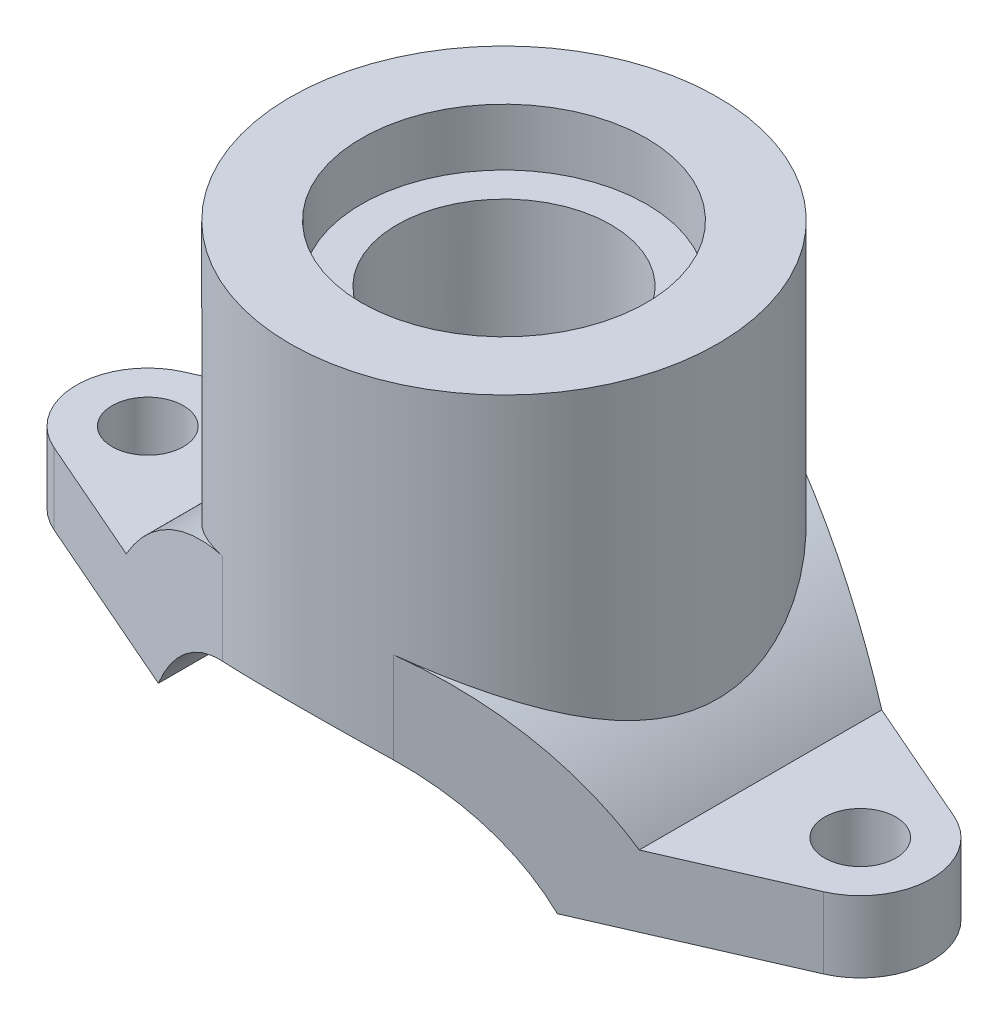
ISO-10303-21;
HEADER;
FILE_DESCRIPTION(('STEP AP214'),'2;1');
FILE_NAME('part.step','',(''),(''),'','','');
FILE_SCHEMA(('AUTOMOTIVE_DESIGN { 1 0 10303 214 1 1 1 1 }'));
ENDSEC;
DATA;
#1=APPLICATION_CONTEXT('core data for automotive mechanical design processes');
#2=APPLICATION_PROTOCOL_DEFINITION('international standard','automotive_design',2000,#1);
#3=PRODUCT_CONTEXT('',#1,'mechanical');
#4=PRODUCT('Part','Part','',(#3));
#5=PRODUCT_RELATED_PRODUCT_CATEGORY('part','',(#4));
#6=PRODUCT_DEFINITION_FORMATION('','',#4);
#7=PRODUCT_DEFINITION_CONTEXT('part definition',#1,'design');
#8=PRODUCT_DEFINITION('design','',#6,#7);
#9=PRODUCT_DEFINITION_SHAPE('','',#8);
#10=(LENGTH_UNIT() NAMED_UNIT(*) SI_UNIT(.MILLI.,.METRE.));
#11=(NAMED_UNIT(*) PLANE_ANGLE_UNIT() SI_UNIT($,.RADIAN.));
#12=(NAMED_UNIT(*) SI_UNIT($,.STERADIAN.) SOLID_ANGLE_UNIT());
#13=UNCERTAINTY_MEASURE_WITH_UNIT(LENGTH_MEASURE(1.E-05),#10,'distance_accuracy_value','');
#14=(GEOMETRIC_REPRESENTATION_CONTEXT(3) GLOBAL_UNCERTAINTY_ASSIGNED_CONTEXT((#13)) GLOBAL_UNIT_ASSIGNED_CONTEXT((#10,
#11,#12)) REPRESENTATION_CONTEXT('',''));
#15=CARTESIAN_POINT('',(0.,0.,0.));
#16=DIRECTION('',(0.,0.,1.));
#17=DIRECTION('',(1.,0.,0.));
#18=AXIS2_PLACEMENT_3D('',#15,#16,#17);
#19=CARTESIAN_POINT('',(0.,-38.7298334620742,75.));
#20=DIRECTION('',(0.,0.,-1.));
#21=DIRECTION('',(-1.,0.,0.));
#22=AXIS2_PLACEMENT_3D('',#19,#20,#21);
#23=CYLINDRICAL_SURFACE('',#22,110.279153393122);
#24=CARTESIAN_POINT('',(0.,-38.7298334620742,81.8317088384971));
#25=DIRECTION('',(0.4,0.,-0.916515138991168));
#26=DIRECTION('',(-0.916515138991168,0.,-0.4));
#27=AXIS2_PLACEMENT_3D('',#24,#25,#26);
#28=ELLIPSE('',#27,120.324420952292,110.279153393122);
#29=CARTESIAN_POINT('',(-90.,25.,42.5524885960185));
#30=VERTEX_POINT('',#29);
#31=CARTESIAN_POINT('',(-30.,67.390342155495,68.7386354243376));
#32=VERTEX_POINT('',#31);
#33=EDGE_CURVE('E59',#30,#32,#28,.T.);
#34=ORIENTED_EDGE('',*,*,#33,.T.);
#35=CARTESIAN_POINT('',(0.,71.5493199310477,75.0000000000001));
#36=CARTESIAN_POINT('',(0.937980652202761,71.5493195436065,74.9999995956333));
#37=CARTESIAN_POINT('',(1.87597517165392,71.5373463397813,74.9823975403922));
#38=CARTESIAN_POINT('',(3.7500477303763,71.4895272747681,74.9120582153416));
#39=CARTESIAN_POINT('',(4.68612572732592,71.4536808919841,74.8593201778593));
#40=CARTESIAN_POINT('',(6.55445736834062,71.3583389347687,74.7189178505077));
#41=CARTESIAN_POINT('',(7.48671097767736,71.2988431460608,74.6312532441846));
#42=CARTESIAN_POINT('',(9.34562177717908,71.1565627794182,74.4213300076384));
#43=CARTESIAN_POINT('',(10.2722783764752,71.0737757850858,74.2990677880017));
#44=CARTESIAN_POINT('',(12.1185294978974,70.8853769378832,74.0203568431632));
#45=CARTESIAN_POINT('',(13.0381206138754,70.7797547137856,73.8638925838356));
#46=CARTESIAN_POINT('',(14.8682065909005,70.5463265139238,73.5173711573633));
#47=CARTESIAN_POINT('',(15.778700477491,70.4185181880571,73.3273104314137));
#48=CARTESIAN_POINT('',(17.5887817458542,70.141487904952,72.914308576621));
#49=CARTESIAN_POINT('',(18.488370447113,69.992268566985,72.6913714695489));
#50=CARTESIAN_POINT('',(20.2753538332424,69.6732366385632,72.213334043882));
#51=CARTESIAN_POINT('',(21.1627472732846,69.5034219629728,71.9582304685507));
#52=CARTESIAN_POINT('',(22.9194239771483,69.1450527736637,71.4180653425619));
#53=CARTESIAN_POINT('',(23.7887763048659,68.9565977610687,71.1331624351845));
#54=CARTESIAN_POINT('',(25.5127799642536,68.5612300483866,70.5331940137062));
#55=CARTESIAN_POINT('',(26.367429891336,68.3543155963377,70.2181256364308));
#56=CARTESIAN_POINT('',(28.9074275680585,67.7074859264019,69.2290460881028));
#57=CARTESIAN_POINT('',(30.569277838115,67.2413908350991,68.5110201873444));
#58=CARTESIAN_POINT('',(33.8217633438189,66.2486056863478,66.9651541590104));
#59=CARTESIAN_POINT('',(35.4124010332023,65.721917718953,66.1373178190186));
#60=CARTESIAN_POINT('',(38.5171161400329,64.6173402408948,64.3786830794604));
#61=CARTESIAN_POINT('',(40.031189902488,64.0394482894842,63.4478797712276));
#62=CARTESIAN_POINT('',(43.1055050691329,62.7905699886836,61.4052872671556));
#63=CARTESIAN_POINT('',(44.6584556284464,62.1158535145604,60.2848114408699));
#64=CARTESIAN_POINT('',(47.6644675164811,60.7303570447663,57.937343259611));
#65=CARTESIAN_POINT('',(49.1175241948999,60.0195753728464,56.7103459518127));
#66=CARTESIAN_POINT('',(51.922191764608,58.574175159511,54.1543274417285));
#67=CARTESIAN_POINT('',(53.273662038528,57.839525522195,52.8251697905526));
#68=CARTESIAN_POINT('',(55.8701050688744,56.3609358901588,50.0710794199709));
#69=CARTESIAN_POINT('',(57.1150715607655,55.6169953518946,48.6461410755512));
#70=CARTESIAN_POINT('',(58.9982688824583,54.44400335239,46.3186701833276));
#71=CARTESIAN_POINT('',(59.6729037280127,54.0130903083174,45.4462587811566));
#72=CARTESIAN_POINT('',(60.9842036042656,53.1561385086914,43.6708689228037));
#73=CARTESIAN_POINT('',(61.6208665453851,52.7301000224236,42.7678887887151));
#74=CARTESIAN_POINT('',(62.8554662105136,51.8860669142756,40.9318279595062));
#75=CARTESIAN_POINT('',(63.4533936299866,51.4680742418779,39.9987401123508));
#76=CARTESIAN_POINT('',(64.6094058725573,50.6436543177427,38.1032405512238));
#77=CARTESIAN_POINT('',(65.1674915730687,50.2372268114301,37.1408294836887));
#78=CARTESIAN_POINT('',(66.2420240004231,49.4400756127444,35.1885505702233));
#79=CARTESIAN_POINT('',(66.758524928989,49.0493318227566,34.1987208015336));
#80=CARTESIAN_POINT('',(67.7494676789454,48.2867867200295,32.1910368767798));
#81=CARTESIAN_POINT('',(68.2239083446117,47.9149859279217,31.1731819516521));
#82=CARTESIAN_POINT('',(69.1290809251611,47.1945304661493,29.1107822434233));
#83=CARTESIAN_POINT('',(69.5598333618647,46.8458649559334,28.0662502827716));
#84=CARTESIAN_POINT('',(70.3762814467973,46.1757001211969,25.95118923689));
#85=CARTESIAN_POINT('',(70.7619767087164,45.8542010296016,24.8806599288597));
#86=CARTESIAN_POINT('',(71.632815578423,45.1192837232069,22.2779540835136));
#87=CARTESIAN_POINT('',(72.0953126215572,44.7211027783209,20.7337565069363));
#88=CARTESIAN_POINT('',(72.9230161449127,43.9988048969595,17.6027055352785));
#89=CARTESIAN_POINT('',(73.2882384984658,43.6746758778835,16.0158591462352));
#90=CARTESIAN_POINT('',(73.9160434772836,43.1120150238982,12.8094661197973));
#91=CARTESIAN_POINT('',(74.1787843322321,42.8733512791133,11.1899739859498));
#92=CARTESIAN_POINT('',(74.5981444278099,42.49017474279,7.92613097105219));
#93=CARTESIAN_POINT('',(74.7547633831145,42.3456622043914,6.28178002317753));
#94=CARTESIAN_POINT('',(74.9594868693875,42.1564255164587,2.97258816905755));
#95=CARTESIAN_POINT('',(75.0070678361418,42.1121828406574,1.30768683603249));
#96=CARTESIAN_POINT('',(74.9912355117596,42.1268691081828,-2.02112411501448));
#97=CARTESIAN_POINT('',(74.9278221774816,42.1857980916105,-3.68503373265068));
#98=CARTESIAN_POINT('',(74.6911768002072,42.4042861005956,-6.99930744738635));
#99=CARTESIAN_POINT('',(74.5178763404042,42.5639078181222,-8.6496624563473));
#100=CARTESIAN_POINT('',(74.0645605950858,42.9771188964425,-11.923607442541));
#101=CARTESIAN_POINT('',(73.7845428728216,43.2307104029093,-13.5471968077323));
#102=CARTESIAN_POINT('',(73.1397784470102,43.8064649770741,-16.6728493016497));
#103=CARTESIAN_POINT('',(72.7802782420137,44.1243070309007,-18.1768061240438));
#104=CARTESIAN_POINT('',(71.97393301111,44.8257163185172,-21.1451765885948));
#105=CARTESIAN_POINT('',(71.5270937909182,45.2092791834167,-22.6095928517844));
#106=CARTESIAN_POINT('',(70.5500976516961,46.0320863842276,-25.495206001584));
#107=CARTESIAN_POINT('',(70.0198923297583,46.4713630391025,-26.9163772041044));
#108=CARTESIAN_POINT('',(68.880383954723,47.3952083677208,-29.7114714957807));
#109=CARTESIAN_POINT('',(68.2710684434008,47.8797841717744,-31.0853870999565));
#110=CARTESIAN_POINT('',(66.6599777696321,49.1304274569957,-34.4443662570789));
#111=CARTESIAN_POINT('',(65.6120534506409,49.9182120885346,-36.3995206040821));
#112=CARTESIAN_POINT('',(63.9219269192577,51.13652810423,-39.2454569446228));
#113=CARTESIAN_POINT('',(63.3386514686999,51.5488695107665,-40.1799045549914));
#114=CARTESIAN_POINT('',(62.1334666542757,52.3825169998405,-42.0195332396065));
#115=CARTESIAN_POINT('',(61.5115581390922,52.8038228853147,-42.9247149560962));
#116=CARTESIAN_POINT('',(60.2289428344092,53.6528420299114,-44.7066174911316));
#117=CARTESIAN_POINT('',(59.5681734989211,54.0805647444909,-45.5832886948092));
#118=CARTESIAN_POINT('',(58.2094891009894,54.9386917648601,-47.306012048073));
#119=CARTESIAN_POINT('',(57.5115738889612,55.3690960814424,-48.1520640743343));
#120=CARTESIAN_POINT('',(56.0793534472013,56.2296087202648,-49.8127317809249));
#121=CARTESIAN_POINT('',(55.3450526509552,56.659717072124,-50.6273512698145));
#122=CARTESIAN_POINT('',(53.8405919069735,57.5168905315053,-52.2244597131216));
#123=CARTESIAN_POINT('',(53.0704317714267,57.943955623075,-53.006948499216));
#124=CARTESIAN_POINT('',(51.4879144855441,58.7960658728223,-54.5456075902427));
#125=CARTESIAN_POINT('',(50.6752454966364,59.2210601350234,-55.3014854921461));
#126=CARTESIAN_POINT('',(49.0146679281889,60.0624757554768,-56.7784911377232));
#127=CARTESIAN_POINT('',(48.1667599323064,60.4788972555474,-57.4996194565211));
#128=CARTESIAN_POINT('',(46.4362215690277,61.3005950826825,-58.9060328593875));
#129=CARTESIAN_POINT('',(45.5535852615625,61.7058694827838,-59.5913117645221));
#130=CARTESIAN_POINT('',(43.7545973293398,62.5025453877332,-60.9244487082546));
#131=CARTESIAN_POINT('',(42.8382496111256,62.8939484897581,-61.5723110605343));
#132=CARTESIAN_POINT('',(40.9741631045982,63.6597326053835,-62.8281691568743));
#133=CARTESIAN_POINT('',(40.0264783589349,64.0341405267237,-63.4362286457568));
#134=CARTESIAN_POINT('',(38.0994611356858,64.764051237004,-64.6119559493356));
#135=CARTESIAN_POINT('',(37.1201325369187,65.1195563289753,-65.179628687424));
#136=CARTESIAN_POINT('',(35.1311141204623,65.8091738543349,-66.2728621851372));
#137=CARTESIAN_POINT('',(34.1214297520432,66.1432900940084,-66.7984304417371));
#138=CARTESIAN_POINT('',(32.0731535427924,66.7877362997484,-67.8057193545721));
#139=CARTESIAN_POINT('',(31.0345635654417,67.0980677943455,-68.2874428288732));
#140=CARTESIAN_POINT('',(28.3444610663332,67.8580526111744,-69.4606544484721));
#141=CARTESIAN_POINT('',(26.6733674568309,68.2891817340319,-70.1197705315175));
#142=CARTESIAN_POINT('',(23.2732581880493,69.0796905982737,-71.3204450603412));
#143=CARTESIAN_POINT('',(21.5442507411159,69.4390804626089,-71.8620200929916));
#144=CARTESIAN_POINT('',(18.0386163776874,70.0785862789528,-72.8210702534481));
#145=CARTESIAN_POINT('',(16.2620139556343,70.358742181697,-73.2386079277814));
#146=CARTESIAN_POINT('',(12.6719545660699,70.8338082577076,-73.9443580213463));
#147=CARTESIAN_POINT('',(10.8584967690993,71.0287165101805,-74.2325675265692));
#148=CARTESIAN_POINT('',(7.20167248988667,71.3292614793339,-74.6762311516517));
#149=CARTESIAN_POINT('',(5.35822493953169,71.434590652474,-74.8312279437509));
#150=CARTESIAN_POINT('',(1.66192925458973,71.5522985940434,-75.0044067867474));
#151=CARTESIAN_POINT('',(-0.190918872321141,71.5646774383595,-75.0225889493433));
#152=CARTESIAN_POINT('',(-3.89121897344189,71.4961826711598,-74.9218545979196));
#153=CARTESIAN_POINT('',(-5.73867068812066,71.4153046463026,-74.8029315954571));
#154=CARTESIAN_POINT('',(-9.41346475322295,71.1622513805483,-74.4298154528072));
#155=CARTESIAN_POINT('',(-11.2408075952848,70.990078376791,-74.175625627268));
#156=CARTESIAN_POINT('',(-14.7651099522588,70.5700444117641,-73.5528475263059));
#157=CARTESIAN_POINT('',(-16.4638258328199,70.3267093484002,-73.1910827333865));
#158=CARTESIAN_POINT('',(-19.8206300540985,69.7668469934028,-72.3542306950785));
#159=CARTESIAN_POINT('',(-21.4787201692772,69.4503229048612,-71.8791484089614));
#160=CARTESIAN_POINT('',(-24.7455238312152,68.7501269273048,-70.8209541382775));
#161=CARTESIAN_POINT('',(-26.3542336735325,68.3664500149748,-70.2378340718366));
#162=CARTESIAN_POINT('',(-29.5148072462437,67.538868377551,-68.9693865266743));
#163=CARTESIAN_POINT('',(-31.0666677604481,67.0949602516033,-68.2840532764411));
#164=CARTESIAN_POINT('',(-34.2299932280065,66.1165126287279,-66.7580310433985));
#165=CARTESIAN_POINT('',(-35.8361978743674,65.5775537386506,-65.9092765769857));
#166=CARTESIAN_POINT('',(-38.9693417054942,64.4479545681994,-64.1066118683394));
#167=CARTESIAN_POINT('',(-40.4962774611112,63.8573120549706,-63.1526970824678));
#168=CARTESIAN_POINT('',(-43.4673454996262,62.634183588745,-61.1457744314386));
#169=CARTESIAN_POINT('',(-44.911426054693,62.0016720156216,-60.092705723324));
#170=CARTESIAN_POINT('',(-47.7123706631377,60.7055888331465,-57.8938709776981));
#171=CARTESIAN_POINT('',(-49.0692300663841,60.0420155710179,-56.7481000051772));
#172=CARTESIAN_POINT('',(-51.9128785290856,58.5815683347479,-54.1694453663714));
#173=CARTESIAN_POINT('',(-53.3833434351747,57.7809890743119,-52.7206220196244));
#174=CARTESIAN_POINT('',(-56.1977481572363,56.1697696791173,-49.7097658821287));
#175=CARTESIAN_POINT('',(-57.5416683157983,55.3591280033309,-48.147715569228));
#176=CARTESIAN_POINT('',(-60.0992125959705,53.7464478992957,-44.9147534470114));
#177=CARTESIAN_POINT('',(-61.3127746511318,52.9444137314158,-43.2437903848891));
#178=CARTESIAN_POINT('',(-63.6035893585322,51.3701438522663,-39.7977775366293));
#179=CARTESIAN_POINT('',(-64.6808638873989,50.5979033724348,-38.0227445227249));
#180=CARTESIAN_POINT('',(-66.5524130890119,49.2100913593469,-34.6264901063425));
#181=CARTESIAN_POINT('',(-67.3652068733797,48.5876766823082,-33.0182625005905));
#182=CARTESIAN_POINT('',(-68.8795169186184,47.3981577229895,-29.7302453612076));
#183=CARTESIAN_POINT('',(-69.5810353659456,46.8310523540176,-28.0504572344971));
#184=CARTESIAN_POINT('',(-70.8651378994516,45.7705611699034,-24.626600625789));
#185=CARTESIAN_POINT('',(-71.4479138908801,45.2770567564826,-22.8826413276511));
#186=CARTESIAN_POINT('',(-72.4884294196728,44.3808869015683,-19.3349980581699));
#187=CARTESIAN_POINT('',(-72.9461945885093,43.9782028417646,-17.5313264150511));
#188=CARTESIAN_POINT('',(-73.6646988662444,43.3384031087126,-14.1757753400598));
#189=CARTESIAN_POINT('',(-73.9454620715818,43.084947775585,-12.6312879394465));
#190=CARTESIAN_POINT('',(-74.4104559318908,42.6622732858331,-9.51643414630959));
#191=CARTESIAN_POINT('',(-74.5946977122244,42.4930444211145,-7.94607075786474));
#192=CARTESIAN_POINT('',(-74.8635607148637,42.245302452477,-4.79084368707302));
#193=CARTESIAN_POINT('',(-74.9482565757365,42.1667213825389,-3.20599176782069));
#194=CARTESIAN_POINT('',(-75.0167870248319,42.1031772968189,-0.0321709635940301));
#195=CARTESIAN_POINT('',(-75.0006195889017,42.1182161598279,1.5567980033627));
#196=CARTESIAN_POINT('',(-74.8677494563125,42.2412710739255,4.72587344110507));
#197=CARTESIAN_POINT('',(-74.7511088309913,42.3492297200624,6.30598477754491));
#198=CARTESIAN_POINT('',(-74.4194013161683,42.65379321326,9.44707532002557));
#199=CARTESIAN_POINT('',(-74.2043351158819,42.8503974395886,11.0080546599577));
#200=CARTESIAN_POINT('',(-73.6788323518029,43.3253091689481,14.1030740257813));
#201=CARTESIAN_POINT('',(-73.3682824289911,43.6037137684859,15.6370797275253));
#202=CARTESIAN_POINT('',(-72.6560945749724,44.2328624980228,18.6686241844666));
#203=CARTESIAN_POINT('',(-72.254444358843,44.5836163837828,20.1661579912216));
#204=CARTESIAN_POINT('',(-71.2220482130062,45.4693963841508,23.5915746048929));
#205=CARTESIAN_POINT('',(-70.5591191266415,46.027474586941,25.5038501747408));
#206=CARTESIAN_POINT('',(-69.0920168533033,47.2276115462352,29.2461290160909));
#207=CARTESIAN_POINT('',(-68.2877985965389,47.8696970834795,31.0761058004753));
#208=CARTESIAN_POINT('',(-66.54561772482,49.2155200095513,34.6502195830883));
#209=CARTESIAN_POINT('',(-65.6075004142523,49.9193283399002,36.3942541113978));
#210=CARTESIAN_POINT('',(-63.6050737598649,51.3668504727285,39.7904600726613));
#211=CARTESIAN_POINT('',(-62.5407730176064,52.1105615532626,41.4426377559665));
#212=CARTESIAN_POINT('',(-60.2684396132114,53.6342057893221,44.6845870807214));
#213=CARTESIAN_POINT('',(-59.0579397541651,54.4145670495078,46.272426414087));
#214=CARTESIAN_POINT('',(-56.5153271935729,55.9788646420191,49.3456679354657));
#215=CARTESIAN_POINT('',(-55.1832139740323,56.7628009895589,50.8310696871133));
#216=CARTESIAN_POINT('',(-52.4007102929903,58.3175693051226,53.6949999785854));
#217=CARTESIAN_POINT('',(-50.9502857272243,59.0883974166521,55.0734974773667));
#218=CARTESIAN_POINT('',(-47.9347710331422,60.6008951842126,57.7172182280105));
#219=CARTESIAN_POINT('',(-46.36967285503,61.3425627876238,58.9824335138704));
#220=CARTESIAN_POINT('',(-43.8372670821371,62.4669234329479,60.8653216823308));
#221=CARTESIAN_POINT('',(-42.9073258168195,62.86495964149,61.5245228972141));
#222=CARTESIAN_POINT('',(-41.0134950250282,63.6441517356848,62.8028507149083));
#223=CARTESIAN_POINT('',(-40.0496089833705,64.0253093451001,63.4219814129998));
#224=CARTESIAN_POINT('',(-38.0886526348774,64.768214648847,64.6186842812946));
#225=CARTESIAN_POINT('',(-37.0915721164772,65.1299562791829,65.1962434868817));
#226=CARTESIAN_POINT('',(-35.0659499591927,65.8312459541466,66.3077184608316));
#227=CARTESIAN_POINT('',(-34.0374128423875,66.1707971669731,66.841640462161));
#228=CARTESIAN_POINT('',(-31.9519262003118,66.8246946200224,67.8632485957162));
#229=CARTESIAN_POINT('',(-30.8950233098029,67.1390792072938,68.3510052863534));
#230=CARTESIAN_POINT('',(-28.753272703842,67.7407166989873,69.2792267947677));
#231=CARTESIAN_POINT('',(-27.6684291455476,68.0279736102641,69.7196985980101));
#232=CARTESIAN_POINT('',(-25.4731087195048,68.5729668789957,70.551385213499));
#233=CARTESIAN_POINT('',(-24.3626397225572,68.8307121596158,70.9426149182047));
#234=CARTESIAN_POINT('',(-22.1184007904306,69.3145363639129,71.6740491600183));
#235=CARTESIAN_POINT('',(-20.9846332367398,69.540618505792,72.0142588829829));
#236=CARTESIAN_POINT('',(-18.2425117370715,70.0421292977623,72.7664441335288));
#237=CARTESIAN_POINT('',(-16.6242574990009,70.3015714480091,73.1533751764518));
#238=CARTESIAN_POINT('',(-13.3563694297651,70.7499254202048,73.8199625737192));
#239=CARTESIAN_POINT('',(-11.7067424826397,70.9388525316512,74.0996421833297));
#240=CARTESIAN_POINT('',(-9.21665989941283,71.1666659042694,74.4362505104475));
#241=CARTESIAN_POINT('',(-8.38408586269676,71.2333380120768,74.5346306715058));
#242=CARTESIAN_POINT('',(-6.71484727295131,71.3478751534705,74.7035086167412));
#243=CARTESIAN_POINT('',(-5.87818306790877,71.3957417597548,74.7740087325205));
#244=CARTESIAN_POINT('',(-4.20192963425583,71.4724334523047,74.8869124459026));
#245=CARTESIAN_POINT('',(-3.36233984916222,71.5012546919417,74.9293103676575));
#246=CARTESIAN_POINT('',(-1.68183702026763,71.5396973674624,74.9858532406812));
#247=CARTESIAN_POINT('',(-0.840924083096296,71.5493202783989,75.0000003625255));
#248=CARTESIAN_POINT('',(0.,71.5493199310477,75.0000000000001));
#249=B_SPLINE_CURVE_WITH_KNOTS('',3,(#35,#36,#37,#38,#39,#40,#41,#42,#43,#44,#45,#46,#47,#48,
#49,#50,#51,#52,#53,#54,#55,#56,#57,#58,#59,#60,#61,#62,#63,#64,#65,#66,#67,#68,#69,#70,#71,#72,
#73,#74,#75,#76,#77,#78,#79,#80,#81,#82,#83,#84,#85,#86,#87,#88,#89,#90,#91,#92,#93,#94,#95,#96,
#97,#98,#99,#100,#101,#102,#103,#104,#105,#106,#107,#108,#109,#110,#111,#112,#113,#114,#115,
#116,#117,#118,#119,#120,#121,#122,#123,#124,#125,#126,#127,#128,#129,#130,#131,#132,#133,#134,
#135,#136,#137,#138,#139,#140,#141,#142,#143,#144,#145,#146,#147,#148,#149,#150,#151,#152,#153,
#154,#155,#156,#157,#158,#159,#160,#161,#162,#163,#164,#165,#166,#167,#168,#169,#170,#171,#172,
#173,#174,#175,#176,#177,#178,#179,#180,#181,#182,#183,#184,#185,#186,#187,#188,#189,#190,#191,
#192,#193,#194,#195,#196,#197,#198,#199,#200,#201,#202,#203,#204,#205,#206,#207,#208,#209,#210,
#211,#212,#213,#214,#215,#216,#217,#218,#219,#220,#221,#222,#223,#224,#225,#226,#227,#228,#229,
#230,#231,#232,#233,#234,#235,#236,#237,#238,#239,#240,#241,#242,#243,#244,#245,#246,#247,#248),
.UNSPECIFIED.,.T.,.F.,(4,2,2,2,2,2,2,2,2,2,2,2,2,2,2,2,2,2,2,2,2,2,2,2,2,2,2,2,2,2,2,2,2,2,2,2,
2,2,2,2,2,2,2,2,2,2,2,2,2,2,2,2,2,2,2,2,2,2,2,2,2,2,2,2,2,2,2,2,2,2,2,2,2,2,2,2,2,2,2,2,2,2,2,2,
2,2,2,2,2,2,2,2,2,2,2,2,2,2,2,2,2,2,2,2,2,2,4),(0.,2.81372498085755,5.62751143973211,
8.44132339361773,11.255427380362,14.0708121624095,16.8864953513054,19.7018343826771,
22.5174586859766,25.3187905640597,28.1203885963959,33.7221342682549,39.3236867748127,
44.9255064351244,51.010730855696,57.096238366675,63.1900200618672,69.2841599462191,
72.8353675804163,76.3867704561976,79.9390232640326,83.4911978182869,87.0386648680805,
90.5862293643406,94.1321196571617,97.6780403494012,102.65437264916,107.629892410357,
112.597699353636,117.56551965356,122.557144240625,127.548770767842,132.543508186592,
137.538359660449,142.269825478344,147.00097688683,151.734885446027,156.469540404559,
163.520917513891,167.048729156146,170.576463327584,174.110039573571,177.643630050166,
181.176791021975,184.709970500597,188.274259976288,191.838490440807,195.403333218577,
198.96776418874,202.526339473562,206.084480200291,209.641985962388,213.199262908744,
218.735293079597,224.27054152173,229.802994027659,235.335571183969,240.887067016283,
246.438558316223,251.990312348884,257.541930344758,262.797493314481,268.052826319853,
273.308552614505,278.564575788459,284.243764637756,289.923198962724,295.60614130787,
301.289386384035,307.924907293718,314.561457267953,321.201153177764,327.839781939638,
333.554114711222,339.268335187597,344.973246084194,350.676986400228,355.442393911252,
360.207252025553,364.968535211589,369.72991394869,374.488353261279,379.24675925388,
384.010836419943,388.775556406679,395.064729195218,401.35591181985,407.654422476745,
413.952504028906,420.377687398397,426.802898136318,433.229967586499,439.657488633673,
443.278558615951,446.899257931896,450.52108156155,454.142386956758,457.758065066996,
461.373208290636,464.987255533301,468.600935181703,473.647703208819,478.693376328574,
481.215849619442,483.73811191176,486.260883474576,488.783461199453),.UNSPECIFIED.);
#250=CARTESIAN_POINT('',(-30.,67.3903421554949,-68.7386354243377));
#251=VERTEX_POINT('',#250);
#252=EDGE_CURVE('E133',#251,#32,#249,.T.);
#253=ORIENTED_EDGE('',*,*,#252,.F.);
#254=CARTESIAN_POINT('',(0.,-38.7298334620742,-81.8317088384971));
#255=DIRECTION('',(0.4,0.,0.916515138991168));
#256=DIRECTION('',(0.916515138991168,0.,-0.4));
#257=AXIS2_PLACEMENT_3D('',#254,#255,#256);
#258=ELLIPSE('',#257,120.324420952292,110.279153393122);
#259=CARTESIAN_POINT('',(-90.,25.,-42.5524885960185));
#260=VERTEX_POINT('',#259);
#261=EDGE_CURVE('E142',#251,#260,#258,.T.);
#262=ORIENTED_EDGE('',*,*,#261,.T.);
#263=DIRECTION('',(0.,0.,-1.));
#264=VECTOR('',#263,1.);
#265=CARTESIAN_POINT('',(-90.,25.,75.));
#266=LINE('',#265,#264);
#267=EDGE_CURVE('E306',#30,#260,#266,.T.);
#268=ORIENTED_EDGE('',*,*,#267,.F.);
#269=EDGE_LOOP('',(#34,#253,#262,#268));
#270=FACE_BOUND('',#269,.T.);
#271=ADVANCED_FACE('F32',(#270),#23,.T.);
#272=CARTESIAN_POINT('',(-150.,25.,75.));
#273=DIRECTION('',(0.,-1.,0.));
#274=DIRECTION('',(0.,0.,-1.));
#275=AXIS2_PLACEMENT_3D('',#272,#273,#274);
#276=PLANE('',#275);
#277=CARTESIAN_POINT('',(-125.,25.,0.));
#278=DIRECTION('',(0.,1.,0.));
#279=DIRECTION('',(0.,0.,1.));
#280=AXIS2_PLACEMENT_3D('',#277,#278,#279);
#281=CIRCLE('',#280,12.5);
#282=CARTESIAN_POINT('',(-125.,25.,12.5));
#283=VERTEX_POINT('',#282);
#284=EDGE_CURVE('E341',#283,#283,#281,.T.);
#285=ORIENTED_EDGE('',*,*,#284,.F.);
#286=EDGE_LOOP('',(#285));
#287=FACE_BOUND('',#286,.T.);
#288=ORIENTED_EDGE('',*,*,#267,.T.);
#289=DIRECTION('',(-0.916515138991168,0.,0.4));
#290=VECTOR('',#289,1.);
#291=CARTESIAN_POINT('',(-183.495454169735,25.,-1.74772708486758));
#292=LINE('',#291,#290);
#293=CARTESIAN_POINT('',(-135.,25.,-22.9128784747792));
#294=VERTEX_POINT('',#293);
#295=EDGE_CURVE('E147',#260,#294,#292,.T.);
#296=ORIENTED_EDGE('',*,*,#295,.T.);
#297=CARTESIAN_POINT('',(-125.,25.,0.));
#298=DIRECTION('',(0.,-1.,0.));
#299=DIRECTION('',(0.,0.,-1.));
#300=AXIS2_PLACEMENT_3D('',#297,#298,#299);
#301=CIRCLE('',#300,25.);
#302=CARTESIAN_POINT('',(-135.,25.,22.9128784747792));
#303=VERTEX_POINT('',#302);
#304=EDGE_CURVE('E313',#294,#303,#301,.F.);
#305=ORIENTED_EDGE('',*,*,#304,.T.);
#306=DIRECTION('',(0.916515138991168,0.,0.4));
#307=VECTOR('',#306,1.);
#308=CARTESIAN_POINT('',(-128.504545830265,25.,25.7477270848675));
#309=LINE('',#308,#307);
#310=EDGE_CURVE('E311',#303,#30,#309,.T.);
#311=ORIENTED_EDGE('',*,*,#310,.T.);
#312=EDGE_LOOP('',(#288,#296,#305,#311));
#313=FACE_BOUND('',#312,.T.);
#314=ADVANCED_FACE('F191',(#287,#313),#276,.F.);
#315=CARTESIAN_POINT('',(0.,-38.7298334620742,-81.8317088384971));
#316=DIRECTION('',(-0.399999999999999,0.,0.916515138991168));
#317=DIRECTION('',(-0.916515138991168,0.,-0.399999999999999));
#318=AXIS2_PLACEMENT_3D('',#315,#316,#317);
#319=ELLIPSE('',#318,120.324420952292,110.279153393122);
#320=CARTESIAN_POINT('',(90.,25.,-42.5524885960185));
#321=VERTEX_POINT('',#320);
#322=CARTESIAN_POINT('',(30.,67.3903421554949,-68.7386354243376));
#323=VERTEX_POINT('',#322);
#324=EDGE_CURVE('E44',#321,#323,#319,.T.);
#325=ORIENTED_EDGE('',*,*,#324,.T.);
#326=CARTESIAN_POINT('',(30.,67.390342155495,68.7386354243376));
#327=VERTEX_POINT('',#326);
#328=EDGE_CURVE('E154',#327,#323,#249,.T.);
#329=ORIENTED_EDGE('',*,*,#328,.F.);
#330=CARTESIAN_POINT('',(0.,-38.7298334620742,81.8317088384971));
#331=DIRECTION('',(-0.4,0.,-0.916515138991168));
#332=DIRECTION('',(0.916515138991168,0.,-0.400000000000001));
#333=AXIS2_PLACEMENT_3D('',#330,#331,#332);
#334=ELLIPSE('',#333,120.324420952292,110.279153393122);
#335=CARTESIAN_POINT('',(90.,25.,42.5524885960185));
#336=VERTEX_POINT('',#335);
#337=EDGE_CURVE('E216',#327,#336,#334,.T.);
#338=ORIENTED_EDGE('',*,*,#337,.T.);
#339=DIRECTION('',(0.,0.,-1.));
#340=VECTOR('',#339,1.);
#341=CARTESIAN_POINT('',(90.,25.,75.));
#342=LINE('',#341,#340);
#343=EDGE_CURVE('E213',#336,#321,#342,.T.);
#344=ORIENTED_EDGE('',*,*,#343,.T.);
#345=EDGE_LOOP('',(#325,#329,#338,#344));
#346=FACE_BOUND('',#345,.T.);
#347=ADVANCED_FACE('F193',(#346),#23,.T.);
#348=CARTESIAN_POINT('',(90.,25.,75.));
#349=DIRECTION('',(0.,-1.,0.));
#350=DIRECTION('',(0.,0.,-1.));
#351=AXIS2_PLACEMENT_3D('',#348,#349,#350);
#352=PLANE('',#351);
#353=CARTESIAN_POINT('',(125.,25.,0.));
#354=DIRECTION('',(0.,1.,0.));
#355=DIRECTION('',(0.,0.,-1.));
#356=AXIS2_PLACEMENT_3D('',#353,#354,#355);
#357=CIRCLE('',#356,12.5);
#358=CARTESIAN_POINT('',(125.,25.,-12.5));
#359=VERTEX_POINT('',#358);
#360=EDGE_CURVE('E347',#359,#359,#357,.T.);
#361=ORIENTED_EDGE('',*,*,#360,.F.);
#362=EDGE_LOOP('',(#361));
#363=FACE_BOUND('',#362,.T.);
#364=ORIENTED_EDGE('',*,*,#343,.F.);
#365=DIRECTION('',(0.916515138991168,0.,-0.4));
#366=VECTOR('',#365,1.);
#367=CARTESIAN_POINT('',(78.1045458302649,25.,47.7440904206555));
#368=LINE('',#367,#366);
#369=CARTESIAN_POINT('',(135.,25.,22.9128784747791));
#370=VERTEX_POINT('',#369);
#371=EDGE_CURVE('E301',#336,#370,#368,.T.);
#372=ORIENTED_EDGE('',*,*,#371,.T.);
#373=CARTESIAN_POINT('',(125.,25.,0.));
#374=DIRECTION('',(0.,-1.,0.));
#375=DIRECTION('',(0.,0.,-1.));
#376=AXIS2_PLACEMENT_3D('',#373,#374,#375);
#377=CIRCLE('',#376,25.);
#378=CARTESIAN_POINT('',(135.,25.,-22.9128784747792));
#379=VERTEX_POINT('',#378);
#380=EDGE_CURVE('E11',#370,#379,#377,.F.);
#381=ORIENTED_EDGE('',*,*,#380,.T.);
#382=DIRECTION('',(-0.916515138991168,0.,-0.399999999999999));
#383=VECTOR('',#382,1.);
#384=CARTESIAN_POINT('',(133.095454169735,25.,-23.7440904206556));
#385=LINE('',#384,#383);
#386=EDGE_CURVE('E276',#379,#321,#385,.T.);
#387=ORIENTED_EDGE('',*,*,#386,.T.);
#388=EDGE_LOOP('',(#364,#372,#381,#387));
#389=FACE_BOUND('',#388,.T.);
#390=ADVANCED_FACE('F201',(#363,#389),#352,.F.);
#391=CARTESIAN_POINT('',(125.,71.5493199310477,0.));
#392=DIRECTION('',(0.,-1.,0.));
#393=DIRECTION('',(0.,0.,-1.));
#394=AXIS2_PLACEMENT_3D('',#391,#392,#393);
#395=CYLINDRICAL_SURFACE('',#394,25.);
#396=CARTESIAN_POINT('',(125.,0.,0.));
#397=DIRECTION('',(0.,1.,0.));
#398=DIRECTION('',(0.,0.,1.));
#399=AXIS2_PLACEMENT_3D('',#396,#397,#398);
#400=CIRCLE('',#399,25.);
#401=CARTESIAN_POINT('',(135.,0.,22.9128784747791));
#402=VERTEX_POINT('',#401);
#403=CARTESIAN_POINT('',(135.,0.,-22.9128784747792));
#404=VERTEX_POINT('',#403);
#405=EDGE_CURVE('E51',#402,#404,#400,.T.);
#406=ORIENTED_EDGE('',*,*,#405,.T.);
#407=DIRECTION('',(0.,-1.,0.));
#408=VECTOR('',#407,1.);
#409=CARTESIAN_POINT('',(135.,71.5493199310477,-22.9128784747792));
#410=LINE('',#409,#408);
#411=EDGE_CURVE('E226',#379,#404,#410,.T.);
#412=ORIENTED_EDGE('',*,*,#411,.F.);
#413=ORIENTED_EDGE('',*,*,#380,.F.);
#414=DIRECTION('',(0.,-1.,0.));
#415=VECTOR('',#414,1.);
#416=CARTESIAN_POINT('',(135.,71.5493199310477,22.9128784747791));
#417=LINE('',#416,#415);
#418=EDGE_CURVE('E223',#370,#402,#417,.T.);
#419=ORIENTED_EDGE('',*,*,#418,.T.);
#420=EDGE_LOOP('',(#406,#412,#413,#419));
#421=FACE_BOUND('',#420,.T.);
#422=ADVANCED_FACE('F206',(#421),#395,.T.);
#423=CARTESIAN_POINT('',(135.,71.5493199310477,22.9128784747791));
#424=DIRECTION('',(-0.4,0.,-0.916515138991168));
#425=DIRECTION('',(-0.916515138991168,0.,0.4));
#426=AXIS2_PLACEMENT_3D('',#423,#424,#425);
#427=PLANE('',#426);
#428=DIRECTION('',(0.916515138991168,0.,-0.4));
#429=VECTOR('',#428,1.);
#430=CARTESIAN_POINT('',(135.,0.,22.9128784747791));
#431=LINE('',#430,#429);
#432=CARTESIAN_POINT('',(70.,0.,51.2812042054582));
#433=VERTEX_POINT('',#432);
#434=EDGE_CURVE('E158',#433,#402,#431,.T.);
#435=ORIENTED_EDGE('',*,*,#434,.T.);
#436=ORIENTED_EDGE('',*,*,#418,.F.);
#437=ORIENTED_EDGE('',*,*,#371,.F.);
#438=ORIENTED_EDGE('',*,*,#337,.F.);
#439=DIRECTION('',(0.,-1.,0.));
#440=VECTOR('',#439,1.);
#441=CARTESIAN_POINT('',(30.,71.5493199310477,68.7386354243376));
#442=LINE('',#441,#440);
#443=CARTESIAN_POINT('',(30.,35.4321514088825,68.7386354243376));
#444=VERTEX_POINT('',#443);
#445=EDGE_CURVE('E219',#327,#444,#442,.T.);
#446=ORIENTED_EDGE('',*,*,#445,.T.);
#447=CARTESIAN_POINT('',(0.,-38.7298334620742,81.8317088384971));
#448=DIRECTION('',(-0.4,0.,-0.916515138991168));
#449=DIRECTION('',(0.916515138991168,0.,-0.400000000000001));
#450=AXIS2_PLACEMENT_3D('',#447,#448,#449);
#451=ELLIPSE('',#450,87.287156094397,80.);
#452=EDGE_CURVE('E304',#433,#444,#451,.F.);
#453=ORIENTED_EDGE('',*,*,#452,.F.);
#454=EDGE_LOOP('',(#435,#436,#437,#438,#446,#453));
#455=FACE_BOUND('',#454,.T.);
#456=ADVANCED_FACE('F242',(#455),#427,.F.);
#457=CARTESIAN_POINT('',(135.,71.5493199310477,-22.9128784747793));
#458=DIRECTION('',(-0.399999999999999,0.,0.916515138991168));
#459=DIRECTION('',(0.916515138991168,0.,0.399999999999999));
#460=AXIS2_PLACEMENT_3D('',#457,#458,#459);
#461=PLANE('',#460);
#462=DIRECTION('',(0.,-1.,0.));
#463=VECTOR('',#462,1.);
#464=CARTESIAN_POINT('',(30.,71.5493199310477,-68.7386354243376));
#465=LINE('',#464,#463);
#466=CARTESIAN_POINT('',(30.,35.4321514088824,-68.7386354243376));
#467=VERTEX_POINT('',#466);
#468=EDGE_CURVE('E138',#323,#467,#465,.T.);
#469=ORIENTED_EDGE('',*,*,#468,.F.);
#470=ORIENTED_EDGE('',*,*,#324,.F.);
#471=ORIENTED_EDGE('',*,*,#386,.F.);
#472=ORIENTED_EDGE('',*,*,#411,.T.);
#473=DIRECTION('',(-0.916515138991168,0.,-0.4));
#474=VECTOR('',#473,1.);
#475=CARTESIAN_POINT('',(135.,0.,-22.9128784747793));
#476=LINE('',#475,#474);
#477=CARTESIAN_POINT('',(70.,0.,-51.2812042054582));
#478=VERTEX_POINT('',#477);
#479=EDGE_CURVE('E274',#404,#478,#476,.T.);
#480=ORIENTED_EDGE('',*,*,#479,.T.);
#481=CARTESIAN_POINT('',(0.,-38.7298334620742,-81.8317088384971));
#482=DIRECTION('',(-0.399999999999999,0.,0.916515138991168));
#483=DIRECTION('',(-0.916515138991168,0.,-0.399999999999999));
#484=AXIS2_PLACEMENT_3D('',#481,#482,#483);
#485=ELLIPSE('',#484,87.2871560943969,80.);
#486=EDGE_CURVE('E299',#467,#478,#485,.F.);
#487=ORIENTED_EDGE('',*,*,#486,.F.);
#488=EDGE_LOOP('',(#469,#470,#471,#472,#480,#487));
#489=FACE_BOUND('',#488,.T.);
#490=ADVANCED_FACE('F246',(#489),#461,.F.);
#491=CARTESIAN_POINT('',(-135.,71.5493199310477,-22.9128784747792));
#492=DIRECTION('',(0.4,0.,0.916515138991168));
#493=DIRECTION('',(0.916515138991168,0.,-0.4));
#494=AXIS2_PLACEMENT_3D('',#491,#492,#493);
#495=PLANE('',#494);
#496=DIRECTION('',(-0.916515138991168,0.,0.4));
#497=VECTOR('',#496,1.);
#498=CARTESIAN_POINT('',(-135.,0.,-22.9128784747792));
#499=LINE('',#498,#497);
#500=CARTESIAN_POINT('',(-69.9999999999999,0.,-51.2812042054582));
#501=VERTEX_POINT('',#500);
#502=CARTESIAN_POINT('',(-135.,0.,-22.9128784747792));
#503=VERTEX_POINT('',#502);
#504=EDGE_CURVE('E282',#501,#503,#499,.T.);
#505=ORIENTED_EDGE('',*,*,#504,.T.);
#506=DIRECTION('',(0.,-1.,0.));
#507=VECTOR('',#506,1.);
#508=CARTESIAN_POINT('',(-135.,71.5493199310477,-22.9128784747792));
#509=LINE('',#508,#507);
#510=EDGE_CURVE('E139',#294,#503,#509,.T.);
#511=ORIENTED_EDGE('',*,*,#510,.F.);
#512=ORIENTED_EDGE('',*,*,#295,.F.);
#513=ORIENTED_EDGE('',*,*,#261,.F.);
#514=DIRECTION('',(0.,-1.,0.));
#515=VECTOR('',#514,1.);
#516=CARTESIAN_POINT('',(-30.,71.5493199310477,-68.7386354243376));
#517=LINE('',#516,#515);
#518=CARTESIAN_POINT('',(-30.,35.4321514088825,-68.7386354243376));
#519=VERTEX_POINT('',#518);
#520=EDGE_CURVE('E126',#251,#519,#517,.T.);
#521=ORIENTED_EDGE('',*,*,#520,.T.);
#522=CARTESIAN_POINT('',(0.,-38.7298334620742,-81.8317088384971));
#523=DIRECTION('',(0.4,0.,0.916515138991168));
#524=DIRECTION('',(0.916515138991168,0.,-0.4));
#525=AXIS2_PLACEMENT_3D('',#522,#523,#524);
#526=ELLIPSE('',#525,87.2871560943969,80.);
#527=EDGE_CURVE('E151',#501,#519,#526,.F.);
#528=ORIENTED_EDGE('',*,*,#527,.F.);
#529=EDGE_LOOP('',(#505,#511,#512,#513,#521,#528));
#530=FACE_BOUND('',#529,.T.);
#531=ADVANCED_FACE('F144',(#530),#495,.F.);
#532=CARTESIAN_POINT('',(-125.,71.5493199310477,0.));
#533=DIRECTION('',(0.,-1.,0.));
#534=DIRECTION('',(0.,0.,-1.));
#535=AXIS2_PLACEMENT_3D('',#532,#533,#534);
#536=CYLINDRICAL_SURFACE('',#535,25.);
#537=CARTESIAN_POINT('',(-125.,0.,0.));
#538=DIRECTION('',(0.,1.,0.));
#539=DIRECTION('',(0.,0.,-1.));
#540=AXIS2_PLACEMENT_3D('',#537,#538,#539);
#541=CIRCLE('',#540,25.);
#542=CARTESIAN_POINT('',(-135.,0.,22.9128784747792));
#543=VERTEX_POINT('',#542);
#544=EDGE_CURVE('E266',#503,#543,#541,.T.);
#545=ORIENTED_EDGE('',*,*,#544,.T.);
#546=DIRECTION('',(0.,-1.,0.));
#547=VECTOR('',#546,1.);
#548=CARTESIAN_POINT('',(-135.,71.5493199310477,22.9128784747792));
#549=LINE('',#548,#547);
#550=EDGE_CURVE('E262',#303,#543,#549,.T.);
#551=ORIENTED_EDGE('',*,*,#550,.F.);
#552=ORIENTED_EDGE('',*,*,#304,.F.);
#553=ORIENTED_EDGE('',*,*,#510,.T.);
#554=EDGE_LOOP('',(#545,#551,#552,#553));
#555=FACE_BOUND('',#554,.T.);
#556=ADVANCED_FACE('F253',(#555),#536,.T.);
#557=CARTESIAN_POINT('',(-135.,71.5493199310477,22.9128784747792));
#558=DIRECTION('',(0.4,0.,-0.916515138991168));
#559=DIRECTION('',(-0.916515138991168,0.,-0.4));
#560=AXIS2_PLACEMENT_3D('',#557,#558,#559);
#561=PLANE('',#560);
#562=DIRECTION('',(0.,-1.,0.));
#563=VECTOR('',#562,1.);
#564=CARTESIAN_POINT('',(-30.,71.5493199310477,68.7386354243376));
#565=LINE('',#564,#563);
#566=CARTESIAN_POINT('',(-30.,35.4321514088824,68.7386354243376));
#567=VERTEX_POINT('',#566);
#568=EDGE_CURVE('E260',#32,#567,#565,.T.);
#569=ORIENTED_EDGE('',*,*,#568,.F.);
#570=ORIENTED_EDGE('',*,*,#33,.F.);
#571=ORIENTED_EDGE('',*,*,#310,.F.);
#572=ORIENTED_EDGE('',*,*,#550,.T.);
#573=DIRECTION('',(0.916515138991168,0.,0.4));
#574=VECTOR('',#573,1.);
#575=CARTESIAN_POINT('',(-135.,0.,22.9128784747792));
#576=LINE('',#575,#574);
#577=CARTESIAN_POINT('',(-70.,0.,51.2812042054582));
#578=VERTEX_POINT('',#577);
#579=EDGE_CURVE('E263',#543,#578,#576,.T.);
#580=ORIENTED_EDGE('',*,*,#579,.T.);
#581=CARTESIAN_POINT('',(0.,-38.7298334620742,81.8317088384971));
#582=DIRECTION('',(0.4,0.,-0.916515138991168));
#583=DIRECTION('',(-0.916515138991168,0.,-0.4));
#584=AXIS2_PLACEMENT_3D('',#581,#582,#583);
#585=ELLIPSE('',#584,87.287156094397,80.);
#586=EDGE_CURVE('E152',#567,#578,#585,.F.);
#587=ORIENTED_EDGE('',*,*,#586,.F.);
#588=EDGE_LOOP('',(#569,#570,#571,#572,#580,#587));
#589=FACE_BOUND('',#588,.T.);
#590=ADVANCED_FACE('F241',(#589),#561,.F.);
#591=CARTESIAN_POINT('',(0.,71.5493199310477,0.));
#592=DIRECTION('',(0.,-1.,0.));
#593=DIRECTION('',(0.,0.,-1.));
#594=AXIS2_PLACEMENT_3D('',#591,#592,#593);
#595=CYLINDRICAL_SURFACE('',#594,75.);
#596=ORIENTED_EDGE('',*,*,#445,.F.);
#597=ORIENTED_EDGE('',*,*,#328,.T.);
#598=ORIENTED_EDGE('',*,*,#468,.T.);
#599=CARTESIAN_POINT('',(-70.,0.,-26.9258240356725));
#600=CARTESIAN_POINT('',(-69.7611664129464,0.431693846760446,-27.546682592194));
#601=CARTESIAN_POINT('',(-69.5149945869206,0.867169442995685,-28.1620566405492));
#602=CARTESIAN_POINT('',(-69.0080664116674,1.74414196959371,-29.3823746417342));
#603=CARTESIAN_POINT('',(-68.7473107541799,2.1856386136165,-29.987319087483));
#604=CARTESIAN_POINT('',(-68.2113163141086,3.07309913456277,-31.1873036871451));
#605=CARTESIAN_POINT('',(-67.9360792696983,3.51906247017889,-31.7823450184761));
#606=CARTESIAN_POINT('',(-67.3711208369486,4.41425392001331,-32.963014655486));
#607=CARTESIAN_POINT('',(-67.0813992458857,4.86348207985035,-33.5486428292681));
#608=CARTESIAN_POINT('',(-66.1896985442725,6.21557899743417,-35.2935192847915));
#609=CARTESIAN_POINT('',(-65.5658836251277,7.12169484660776,-36.4391939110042));
#610=CARTESIAN_POINT('',(-64.2598122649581,8.93488647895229,-38.695942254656));
#611=CARTESIAN_POINT('',(-63.5775535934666,9.84196229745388,-39.8070146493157));
#612=CARTESIAN_POINT('',(-62.1462478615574,11.6606156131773,-42.0069569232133));
#613=CARTESIAN_POINT('',(-61.3965584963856,12.5721357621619,-43.0954569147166));
#614=CARTESIAN_POINT('',(-59.8359628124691,14.384076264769,-45.2372990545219));
#615=CARTESIAN_POINT('',(-59.0250558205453,15.2844964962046,-46.290640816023));
#616=CARTESIAN_POINT('',(-57.341613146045,17.0683966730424,-48.3602881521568));
#617=CARTESIAN_POINT('',(-56.4691174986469,17.9518871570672,-49.3766171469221));
#618=CARTESIAN_POINT('',(-54.6612100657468,19.6973087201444,-51.3708408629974));
#619=CARTESIAN_POINT('',(-53.7258042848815,20.5592418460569,-52.3487392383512));
#620=CARTESIAN_POINT('',(-51.4388660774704,22.5655482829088,-54.6121770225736));
#621=CARTESIAN_POINT('',(-50.0597765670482,23.6985590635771,-55.8801675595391));
#622=CARTESIAN_POINT('',(-47.1810048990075,25.9017221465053,-58.3311734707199));
#623=CARTESIAN_POINT('',(-45.6813289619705,26.9718776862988,-59.5141932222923));
#624=CARTESIAN_POINT('',(-42.5666533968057,29.0311605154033,-61.7800509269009));
#625=CARTESIAN_POINT('',(-40.9521100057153,30.0205781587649,-62.8632498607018));
#626=CARTESIAN_POINT('',(-37.6043172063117,31.9073000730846,-64.9212865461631));
#627=CARTESIAN_POINT('',(-35.8710923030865,32.8046232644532,-65.8961465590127));
#628=CARTESIAN_POINT('',(-32.6471859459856,34.3227083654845,-67.5407491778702));
#629=CARTESIAN_POINT('',(-31.1769118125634,34.9629645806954,-68.2325980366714));
#630=CARTESIAN_POINT('',(-28.1670905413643,36.1650173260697,-69.5291142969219));
#631=CARTESIAN_POINT('',(-26.6275510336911,36.726822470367,-70.13379127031));
#632=CARTESIAN_POINT('',(-24.2713964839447,37.5039149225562,-70.9689702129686));
#633=CARTESIAN_POINT('',(-23.4780597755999,37.7520479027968,-71.2354311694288));
#634=CARTESIAN_POINT('',(-21.8767214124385,38.2253857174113,-71.7433918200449));
#635=CARTESIAN_POINT('',(-21.0687213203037,38.4505929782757,-71.9848941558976));
#636=CARTESIAN_POINT('',(-19.4390564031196,38.8770778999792,-72.441972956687));
#637=CARTESIAN_POINT('',(-18.6173896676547,39.0783521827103,-72.6575457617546));
#638=CARTESIAN_POINT('',(-16.9618738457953,39.455942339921,-73.0617597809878));
#639=CARTESIAN_POINT('',(-16.1280261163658,39.6322609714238,-73.2504039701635));
#640=CARTESIAN_POINT('',(-14.4436508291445,39.9602055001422,-73.6011285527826));
#641=CARTESIAN_POINT('',(-13.5930475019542,40.1116506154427,-73.7630145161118));
#642=CARTESIAN_POINT('',(-11.8825820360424,40.3875134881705,-74.0577969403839));
#643=CARTESIAN_POINT('',(-11.0227209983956,40.5119344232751,-74.1906968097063));
#644=CARTESIAN_POINT('',(-9.29532404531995,40.7330836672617,-74.4268561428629));
#645=CARTESIAN_POINT('',(-8.42778754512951,40.8298098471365,-74.5301133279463));
#646=CARTESIAN_POINT('',(-6.68696919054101,40.9949987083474,-74.7064241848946));
#647=CARTESIAN_POINT('',(-5.81368735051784,41.0634614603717,-74.7794779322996));
#648=CARTESIAN_POINT('',(-4.06370777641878,41.171696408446,-74.894958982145));
#649=CARTESIAN_POINT('',(-3.18701169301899,41.2114810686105,-74.9373995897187));
#650=CARTESIAN_POINT('',(-1.43182794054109,41.2621703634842,-74.991471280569));
#651=CARTESIAN_POINT('',(-0.553340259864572,41.2730748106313,-75.0031021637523));
#652=CARTESIAN_POINT('',(1.2033115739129,41.2659380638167,-74.9954896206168));
#653=CARTESIAN_POINT('',(2.08147574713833,41.2478991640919,-74.9762486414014));
#654=CARTESIAN_POINT('',(3.8355059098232,41.1829881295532,-74.9070036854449));
#655=CARTESIAN_POINT('',(4.71137195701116,41.1361167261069,-74.8570004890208));
#656=CARTESIAN_POINT('',(6.36103911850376,41.0206669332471,-74.7338124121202));
#657=CARTESIAN_POINT('',(7.13529547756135,40.9551039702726,-74.6638471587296));
#658=CARTESIAN_POINT('',(8.67914878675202,40.8017588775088,-74.5001677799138));
#659=CARTESIAN_POINT('',(9.4487453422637,40.713974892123,-74.4064516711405));
#660=CARTESIAN_POINT('',(10.9817774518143,40.5166028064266,-74.1956806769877));
#661=CARTESIAN_POINT('',(11.7452141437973,40.4070188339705,-74.078630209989));
#662=CARTESIAN_POINT('',(13.2648674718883,40.1665253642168,-73.8216599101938));
#663=CARTESIAN_POINT('',(14.0210834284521,40.0356138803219,-73.6817379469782));
#664=CARTESIAN_POINT('',(16.2770930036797,39.6117017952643,-73.2284623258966));
#665=CARTESIAN_POINT('',(17.7645363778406,39.2874862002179,-72.8815590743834));
#666=CARTESIAN_POINT('',(20.6975172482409,38.5611545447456,-72.1035106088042));
#667=CARTESIAN_POINT('',(22.143052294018,38.1590339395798,-71.6723604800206));
#668=CARTESIAN_POINT('',(25.041694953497,37.2655789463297,-70.7130427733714));
#669=CARTESIAN_POINT('',(26.4928716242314,36.7713617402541,-70.1817307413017));
#670=CARTESIAN_POINT('',(29.3373842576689,35.712235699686,-69.0410494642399));
#671=CARTESIAN_POINT('',(30.7307204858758,35.1473271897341,-68.431680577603));
#672=CARTESIAN_POINT('',(33.455859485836,33.953856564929,-67.1414839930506));
#673=CARTESIAN_POINT('',(34.7876507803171,33.3252826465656,-66.4606430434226));
#674=CARTESIAN_POINT('',(37.3870365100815,32.0114597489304,-65.033898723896));
#675=CARTESIAN_POINT('',(38.6546223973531,31.3262032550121,-64.2879867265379));
#676=CARTESIAN_POINT('',(40.8330218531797,30.0731473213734,-62.9198437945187));
#677=CARTESIAN_POINT('',(41.7575568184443,29.5156894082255,-62.3098524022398));
#678=CARTESIAN_POINT('',(43.567852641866,28.3744663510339,-61.0577871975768));
#679=CARTESIAN_POINT('',(44.4536133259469,27.7907010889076,-60.4157132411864));
#680=CARTESIAN_POINT('',(46.1866033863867,26.5993612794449,-59.1014450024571));
#681=CARTESIAN_POINT('',(47.0338172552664,25.9917773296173,-58.4292388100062));
#682=CARTESIAN_POINT('',(48.6893742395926,24.7556952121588,-57.0569967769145));
#683=CARTESIAN_POINT('',(49.497717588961,24.127197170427,-56.3569611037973));
#684=CARTESIAN_POINT('',(51.8700080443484,22.2098436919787,-54.2130620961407));
#685=CARTESIAN_POINT('',(53.3759498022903,20.8927800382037,-52.7294229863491));
#686=CARTESIAN_POINT('',(55.519994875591,18.876533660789,-50.434375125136));
#687=CARTESIAN_POINT('',(56.2155566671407,18.197649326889,-49.657729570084));
#688=CARTESIAN_POINT('',(57.5690797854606,16.828489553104,-48.0820090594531));
#689=CARTESIAN_POINT('',(58.227043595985,16.1382148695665,-47.2829355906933));
#690=CARTESIAN_POINT('',(59.4547876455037,14.8041119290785,-45.7277807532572));
#691=CARTESIAN_POINT('',(60.0274159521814,14.1609693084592,-44.9733523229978));
#692=CARTESIAN_POINT('',(61.1415316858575,12.8690098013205,-43.4465895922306));
#693=CARTESIAN_POINT('',(61.6830195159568,12.2201929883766,-42.6742555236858));
#694=CARTESIAN_POINT('',(62.7351338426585,10.918962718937,-41.1119194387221));
#695=CARTESIAN_POINT('',(63.2457623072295,10.266549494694,-40.3219185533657));
#696=CARTESIAN_POINT('',(64.2364688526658,8.96029111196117,-38.7241486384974));
#697=CARTESIAN_POINT('',(64.7165469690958,8.30644595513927,-37.9163796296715));
#698=CARTESIAN_POINT('',(65.6424984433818,7.00521525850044,-36.2895456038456));
#699=CARTESIAN_POINT('',(66.088623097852,6.35782122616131,-35.4706304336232));
#700=CARTESIAN_POINT('',(66.951150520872,5.06681100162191,-33.8144230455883));
#701=CARTESIAN_POINT('',(67.3675541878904,4.42319469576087,-32.9771313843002));
#702=CARTESIAN_POINT('',(68.1707034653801,3.14290337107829,-31.2831262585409));
#703=CARTESIAN_POINT('',(68.5574478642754,2.50622863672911,-30.4264120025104));
#704=CARTESIAN_POINT('',(69.1152071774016,1.55940114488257,-29.1257724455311));
#705=CARTESIAN_POINT('',(69.2974109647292,1.24513752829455,-28.689604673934));
#706=CARTESIAN_POINT('',(69.6543305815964,0.619930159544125,-27.8118423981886));
#707=CARTESIAN_POINT('',(69.8290462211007,0.308986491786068,-27.3702477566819));
#708=CARTESIAN_POINT('',(70.,0.,-26.9258240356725));
#709=B_SPLINE_CURVE_WITH_KNOTS('',3,(#599,#600,#601,#602,#603,#604,#605,#606,#607,#608,#609,
#610,#611,#612,#613,#614,#615,#616,#617,#618,#619,#620,#621,#622,#623,#624,#625,#626,#627,#628,
#629,#630,#631,#632,#633,#634,#635,#636,#637,#638,#639,#640,#641,#642,#643,#644,#645,#646,#647,
#648,#649,#650,#651,#652,#653,#654,#655,#656,#657,#658,#659,#660,#661,#662,#663,#664,#665,#666,
#667,#668,#669,#670,#671,#672,#673,#674,#675,#676,#677,#678,#679,#680,#681,#682,#683,#684,#685,
#686,#687,#688,#689,#690,#691,#692,#693,#694,#695,#696,#697,#698,#699,#700,#701,#702,#703,#704,
#705,#706,#707,#708),.UNSPECIFIED.,.F.,.F.,(4,2,2,2,2,2,2,2,2,2,2,2,2,2,2,2,2,2,2,2,2,2,2,2,2,2,
2,2,2,2,2,2,2,2,2,2,2,2,2,2,2,2,2,2,2,2,2,2,2,2,2,2,2,2,4),(0.,2.37893366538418,4.7577545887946,
7.13629063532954,9.51485998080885,14.2782137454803,19.0417493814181,23.8567832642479,
28.67187010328,33.4838552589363,38.2953817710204,44.8578585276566,51.4199969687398,
57.9573882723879,64.4934337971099,69.7282799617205,74.9625508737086,77.5806116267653,
80.1983949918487,82.8165474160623,85.4344103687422,88.0705302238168,90.7063399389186,
93.3423522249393,95.9783579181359,98.6132172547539,101.248093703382,103.88276130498,
106.517362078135,108.857191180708,111.197215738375,113.536797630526,115.876597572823,
120.55532053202,125.234316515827,130.097017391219,134.959695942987,139.823277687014,
144.687505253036,148.406250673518,152.12501278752,155.845257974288,159.565480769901,
167.028547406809,170.760369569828,174.491944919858,177.925953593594,181.359917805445,
184.793662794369,188.227403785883,191.632583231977,195.037659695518,198.442875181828,
200.145686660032,201.84854132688),.UNSPECIFIED.);
#710=EDGE_CURVE('E135',#519,#467,#709,.T.);
#711=ORIENTED_EDGE('',*,*,#710,.F.);
#712=ORIENTED_EDGE('',*,*,#520,.F.);
#713=ORIENTED_EDGE('',*,*,#252,.T.);
#714=ORIENTED_EDGE('',*,*,#568,.T.);
#715=CARTESIAN_POINT('',(0.,41.2701665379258,-75.));
#716=CARTESIAN_POINT('',(0.855813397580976,41.270165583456,-74.999999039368));
#717=CARTESIAN_POINT('',(1.71166363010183,41.2564262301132,-74.9853442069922));
#718=CARTESIAN_POINT('',(3.42158310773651,41.2015412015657,-74.9267959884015));
#719=CARTESIAN_POINT('',(4.27565208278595,41.1603916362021,-74.8828984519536));
#720=CARTESIAN_POINT('',(5.98055841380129,41.0508847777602,-74.7660579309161));
#721=CARTESIAN_POINT('',(6.83139357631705,40.982511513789,-74.6930978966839));
#722=CARTESIAN_POINT('',(8.52761798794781,40.8189303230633,-74.5184993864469));
#723=CARTESIAN_POINT('',(9.37300658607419,40.723719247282,-74.4168575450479));
#724=CARTESIAN_POINT('',(11.0585925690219,40.5067198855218,-74.1851268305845));
#725=CARTESIAN_POINT('',(11.89877202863,40.3848666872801,-74.0549684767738));
#726=CARTESIAN_POINT('',(13.5702924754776,40.1153560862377,-73.7669742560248));
#727=CARTESIAN_POINT('',(14.401632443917,39.9676957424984,-73.6091352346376));
#728=CARTESIAN_POINT('',(16.0536282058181,39.6473873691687,-73.2665846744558));
#729=CARTESIAN_POINT('',(16.8742870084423,39.4747465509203,-73.0818808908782));
#730=CARTESIAN_POINT('',(18.5038706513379,39.1052800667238,-72.6863802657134));
#731=CARTESIAN_POINT('',(19.3127942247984,38.9084518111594,-72.4755806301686));
#732=CARTESIAN_POINT('',(20.9116813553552,38.493082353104,-72.0304455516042));
#733=CARTESIAN_POINT('',(21.7017406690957,38.2747117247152,-71.7962948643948));
#734=CARTESIAN_POINT('',(23.2679555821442,37.8160248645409,-71.3041119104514));
#735=CARTESIAN_POINT('',(24.0441098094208,37.5757064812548,-71.0460773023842));
#736=CARTESIAN_POINT('',(26.3500960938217,36.8233633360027,-70.237629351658));
#737=CARTESIAN_POINT('',(27.857844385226,36.2798478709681,-69.6527619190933));
#738=CARTESIAN_POINT('',(30.8068213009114,35.1176549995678,-68.3996085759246));
#739=CARTESIAN_POINT('',(32.2480833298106,34.4990159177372,-67.7313651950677));
#740=CARTESIAN_POINT('',(35.0612419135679,33.1945284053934,-66.318829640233));
#741=CARTESIAN_POINT('',(36.433130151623,32.5086719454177,-65.5745283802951));
#742=CARTESIAN_POINT('',(39.6469486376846,30.787473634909,-63.7012025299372));
#743=CARTESIAN_POINT('',(41.4539053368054,29.7231896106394,-62.5385567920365));
#744=CARTESIAN_POINT('',(44.9230276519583,27.498342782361,-60.0951475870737));
#745=CARTESIAN_POINT('',(46.5851394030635,26.3377444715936,-58.8143405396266));
#746=CARTESIAN_POINT('',(49.7692951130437,23.9359945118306,-56.1457524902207));
#747=CARTESIAN_POINT('',(51.2909003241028,22.6946098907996,-54.7576597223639));
#748=CARTESIAN_POINT('',(54.1904981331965,20.1523089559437,-51.8897714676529));
#749=CARTESIAN_POINT('',(55.5685049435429,18.8513985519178,-50.4099850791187));
#750=CARTESIAN_POINT('',(57.707080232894,16.6893811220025,-47.9219904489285));
#751=CARTESIAN_POINT('',(58.5095963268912,15.8408396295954,-46.9385380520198));
#752=CARTESIAN_POINT('',(60.05888212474,14.1309409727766,-44.9391845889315));
#753=CARTESIAN_POINT('',(60.8056484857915,13.2695830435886,-43.9232815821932));
#754=CARTESIAN_POINT('',(62.2446246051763,11.538194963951,-41.8591775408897));
#755=CARTESIAN_POINT('',(62.9367953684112,10.668159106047,-40.8109541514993));
#756=CARTESIAN_POINT('',(64.2666607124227,8.92515311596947,-38.6829497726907));
#757=CARTESIAN_POINT('',(64.9043572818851,8.05218309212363,-37.6031699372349));
#758=CARTESIAN_POINT('',(66.1242578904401,6.3113606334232,-35.4139651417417));
#759=CARTESIAN_POINT('',(66.7065974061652,5.44350085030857,-34.3046215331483));
#760=CARTESIAN_POINT('',(67.8178689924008,3.71766078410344,-32.0517492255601));
#761=CARTESIAN_POINT('',(68.3467954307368,2.85968155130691,-30.9082169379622));
#762=CARTESIAN_POINT('',(69.3503925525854,1.16368302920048,-28.5853492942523));
#763=CARTESIAN_POINT('',(69.8251245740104,0.32564204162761,-27.4060563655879));
#764=CARTESIAN_POINT('',(70.7201050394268,-1.31937907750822,-25.0061409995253));
#765=CARTESIAN_POINT('',(71.1403697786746,-2.12636844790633,-23.7855310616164));
#766=CARTESIAN_POINT('',(71.8059024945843,-3.45539578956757,-21.6734627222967));
#767=CARTESIAN_POINT('',(72.0656195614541,-3.98970860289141,-20.7942871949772));
#768=CARTESIAN_POINT('',(72.5567064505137,-5.02740709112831,-19.0100193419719));
#769=CARTESIAN_POINT('',(72.7880763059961,-5.53079280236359,-18.1049270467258));
#770=CARTESIAN_POINT('',(73.2208101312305,-6.49642741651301,-16.2666467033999));
#771=CARTESIAN_POINT('',(73.4221961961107,-6.95870650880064,-15.3334799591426));
#772=CARTESIAN_POINT('',(73.7002394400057,-7.6118168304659,-13.9107145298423));
#773=CARTESIAN_POINT('',(73.7889085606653,-7.82278731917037,-13.432661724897));
#774=CARTESIAN_POINT('',(73.9579356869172,-8.22946950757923,-12.4684968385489));
#775=CARTESIAN_POINT('',(74.0382914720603,-8.4251771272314,-11.9823826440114));
#776=CARTESIAN_POINT('',(74.2347326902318,-8.9085869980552,-10.7155097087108));
#777=CARTESIAN_POINT('',(74.3442435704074,-9.1831849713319,-9.92863449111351));
#778=CARTESIAN_POINT('',(74.5396506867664,-9.67967290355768,-8.33570319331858));
#779=CARTESIAN_POINT('',(74.6255553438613,-9.90158165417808,-7.52965406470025));
#780=CARTESIAN_POINT('',(74.7718102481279,-10.2830719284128,-5.90266369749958));
#781=CARTESIAN_POINT('',(74.8322262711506,-10.4428137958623,-5.08176656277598));
#782=CARTESIAN_POINT('',(74.9262019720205,-10.6926738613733,-3.4278262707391));
#783=CARTESIAN_POINT('',(74.9597640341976,-10.7827982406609,-2.59478419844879));
#784=CARTESIAN_POINT('',(74.9991351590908,-10.888621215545,-0.916425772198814));
#785=CARTESIAN_POINT('',(75.0047161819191,-10.9037082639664,-0.0710646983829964));
#786=CARTESIAN_POINT('',(74.9873152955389,-10.8568519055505,1.61718670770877));
#787=CARTESIAN_POINT('',(74.9643330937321,-10.794907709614,2.46007701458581));
#788=CARTESIAN_POINT('',(74.8905025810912,-10.5975832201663,4.13751560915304));
#789=CARTESIAN_POINT('',(74.8395997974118,-10.4620593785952,4.97204433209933));
#790=CARTESIAN_POINT('',(74.7113863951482,-10.1249205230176,6.62547820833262));
#791=CARTESIAN_POINT('',(74.6340706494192,-9.92329267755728,7.44438029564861));
#792=CARTESIAN_POINT('',(74.4181626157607,-9.3690148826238,9.39434468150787));
#793=CARTESIAN_POINT('',(74.2674417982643,-8.98832625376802,10.5160718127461));
#794=CARTESIAN_POINT('',(73.9220691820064,-8.14001518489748,12.7190059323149));
#795=CARTESIAN_POINT('',(73.7273911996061,-7.67234096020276,13.8001883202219));
#796=CARTESIAN_POINT('',(73.2973142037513,-6.67048189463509,15.9275094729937));
#797=CARTESIAN_POINT('',(73.0617682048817,-6.13605899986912,16.9735048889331));
#798=CARTESIAN_POINT('',(72.5533422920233,-5.01946329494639,19.0298226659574));
#799=CARTESIAN_POINT('',(72.2804672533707,-4.43729672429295,20.0401496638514));
#800=CARTESIAN_POINT('',(71.6714088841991,-3.18068194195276,22.1246132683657));
#801=CARTESIAN_POINT('',(71.3316646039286,-2.50273670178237,23.1955861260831));
#802=CARTESIAN_POINT('',(70.6110932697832,-1.11755395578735,25.3044498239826));
#803=CARTESIAN_POINT('',(70.2302567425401,-0.410309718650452,26.342332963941));
#804=CARTESIAN_POINT('',(69.428091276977,1.02461944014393,28.3892468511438));
#805=CARTESIAN_POINT('',(69.0067282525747,1.75232119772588,29.39825236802));
#806=CARTESIAN_POINT('',(68.1242282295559,3.22041311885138,31.389088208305));
#807=CARTESIAN_POINT('',(67.6630943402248,3.96080228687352,32.3709206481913));
#808=CARTESIAN_POINT('',(66.7003878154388,5.44986326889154,34.3108209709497));
#809=CARTESIAN_POINT('',(66.1987551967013,6.19854589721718,35.2688507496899));
#810=CARTESIAN_POINT('',(65.1555178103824,7.69853275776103,37.1608045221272));
#811=CARTESIAN_POINT('',(64.613912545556,8.44983702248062,38.0947282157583));
#812=CARTESIAN_POINT('',(63.4906604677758,9.95090692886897,39.9387157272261));
#813=CARTESIAN_POINT('',(62.909029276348,10.7006730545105,40.8487886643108));
#814=CARTESIAN_POINT('',(61.7051354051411,12.1955764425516,42.6455821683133));
#815=CARTESIAN_POINT('',(61.0828723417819,12.9407136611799,43.5323025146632));
#816=CARTESIAN_POINT('',(59.7328366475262,14.4975417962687,45.3697576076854));
#817=CARTESIAN_POINT('',(59.0007389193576,15.3084227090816,46.3180073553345));
#818=CARTESIAN_POINT('',(57.4860880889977,16.9170011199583,48.185003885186));
#819=CARTESIAN_POINT('',(56.703534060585,17.7146983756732,49.1037501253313));
#820=CARTESIAN_POINT('',(55.0869803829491,19.293450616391,50.9106532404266));
#821=CARTESIAN_POINT('',(54.2529622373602,20.0744994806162,51.7987989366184));
#822=CARTESIAN_POINT('',(52.5330823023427,21.6159099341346,53.5422694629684));
#823=CARTESIAN_POINT('',(51.6472212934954,22.3762718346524,54.3975947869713));
#824=CARTESIAN_POINT('',(49.8259040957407,23.8701841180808,56.0705220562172));
#825=CARTESIAN_POINT('',(48.8906103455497,24.6038103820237,56.8882328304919));
#826=CARTESIAN_POINT('',(46.9674877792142,26.042826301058,58.486049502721));
#827=CARTESIAN_POINT('',(45.9796569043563,26.7482148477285,59.2661539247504));
#828=CARTESIAN_POINT('',(43.9519387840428,28.1261958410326,60.7851188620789));
#829=CARTESIAN_POINT('',(42.9120832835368,28.7988078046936,61.5240039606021));
#830=CARTESIAN_POINT('',(40.7801789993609,30.1072292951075,62.9573409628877));
#831=CARTESIAN_POINT('',(39.6881379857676,30.7430442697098,63.6517994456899));
#832=CARTESIAN_POINT('',(37.1739010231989,32.1266425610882,65.1594265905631));
#833=CARTESIAN_POINT('',(35.737182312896,32.8629057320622,65.9591201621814));
#834=CARTESIAN_POINT('',(32.785980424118,34.2615764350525,67.4746692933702));
#835=CARTESIAN_POINT('',(31.2715112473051,34.9239971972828,68.1905398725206));
#836=CARTESIAN_POINT('',(28.1692957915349,36.1652855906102,69.5294313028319));
#837=CARTESIAN_POINT('',(26.5815787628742,36.7441861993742,70.1524888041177));
#838=CARTESIAN_POINT('',(24.1503540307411,37.5426334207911,71.0105633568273));
#839=CARTESIAN_POINT('',(23.3315335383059,37.7971676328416,71.2838745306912));
#840=CARTESIAN_POINT('',(21.6783867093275,38.2817829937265,71.8038855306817));
#841=CARTESIAN_POINT('',(20.8440621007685,38.5118668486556,72.0505883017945));
#842=CARTESIAN_POINT('',(19.1537908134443,38.9483546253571,72.5183289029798));
#843=CARTESIAN_POINT('',(18.2977189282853,39.1545341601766,72.7391237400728));
#844=CARTESIAN_POINT('',(16.5726182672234,39.5397600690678,73.1514502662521));
#845=CARTESIAN_POINT('',(15.703591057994,39.7188096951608,73.3429854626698));
#846=CARTESIAN_POINT('',(13.9540612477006,40.04882272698,73.695865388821));
#847=CARTESIAN_POINT('',(13.0735577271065,40.1997838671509,73.8572076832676));
#848=CARTESIAN_POINT('',(11.3029578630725,40.4727264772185,74.1488242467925));
#849=CARTESIAN_POINT('',(10.4128615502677,40.5947080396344,74.2790986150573));
#850=CARTESIAN_POINT('',(8.62558363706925,40.8088920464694,74.5077879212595));
#851=CARTESIAN_POINT('',(7.72840674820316,40.9011128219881,74.6062224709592));
#852=CARTESIAN_POINT('',(5.92849318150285,41.0553081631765,74.7707807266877));
#853=CARTESIAN_POINT('',(5.025756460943,41.1172824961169,74.836904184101));
#854=CARTESIAN_POINT('',(3.2169948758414,41.2105877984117,74.9364480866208));
#855=CARTESIAN_POINT('',(2.31097035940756,41.2419219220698,74.9698718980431));
#856=CARTESIAN_POINT('',(0.497780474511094,41.2737558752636,75.0038288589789));
#857=CARTESIAN_POINT('',(-0.409384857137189,41.2742566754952,75.004363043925));
#858=CARTESIAN_POINT('',(-2.10968384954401,41.2462845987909,74.9745255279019));
#859=CARTESIAN_POINT('',(-2.90294896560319,41.2214122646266,74.9479944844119));
#860=CARTESIAN_POINT('',(-4.48722823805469,41.1481586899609,74.8698458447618));
#861=CARTESIAN_POINT('',(-5.27824219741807,41.0997754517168,74.8182261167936));
#862=CARTESIAN_POINT('',(-6.85632213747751,40.9797451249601,74.6901427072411));
#863=CARTESIAN_POINT('',(-7.64338886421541,40.9081026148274,74.6136839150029));
#864=CARTESIAN_POINT('',(-9.21239182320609,40.7418865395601,74.4362495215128));
#865=CARTESIAN_POINT('',(-9.99432754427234,40.6473107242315,74.3352715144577));
#866=CARTESIAN_POINT('',(-11.5516234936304,40.4356727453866,74.10923661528));
#867=CARTESIAN_POINT('',(-12.3269839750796,40.3186114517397,73.9841806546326));
#868=CARTESIAN_POINT('',(-13.8699069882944,40.0625367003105,73.710514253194));
#869=CARTESIAN_POINT('',(-14.6374687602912,39.9235211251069,73.5619015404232));
#870=CARTESIAN_POINT('',(-16.9265387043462,39.4744413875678,73.0816091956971));
#871=CARTESIAN_POINT('',(-18.4347788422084,39.1322966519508,72.7154246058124));
#872=CARTESIAN_POINT('',(-21.403686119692,38.3689886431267,71.8974956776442));
#873=CARTESIAN_POINT('',(-22.8644402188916,37.9479806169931,71.4459194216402));
#874=CARTESIAN_POINT('',(-25.7350835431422,37.0327876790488,70.4628057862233));
#875=CARTESIAN_POINT('',(-27.1449744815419,36.5386052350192,69.9312711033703));
#876=CARTESIAN_POINT('',(-29.9089359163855,35.4836709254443,68.794542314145));
#877=CARTESIAN_POINT('',(-31.2630040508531,34.9229162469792,68.1893450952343));
#878=CARTESIAN_POINT('',(-33.9120765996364,33.7413671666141,66.9113908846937));
#879=CARTESIAN_POINT('',(-35.2070684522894,33.1205600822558,66.2386196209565));
#880=CARTESIAN_POINT('',(-37.4077336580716,31.9933529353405,65.0139262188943));
#881=CARTESIAN_POINT('',(-38.3273577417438,31.4989756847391,64.4758451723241));
#882=CARTESIAN_POINT('',(-40.1320004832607,30.4835644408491,63.3683142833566));
#883=CARTESIAN_POINT('',(-41.0170252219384,29.9625351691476,62.7988699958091));
#884=CARTESIAN_POINT('',(-43.6206503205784,28.362558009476,61.0460281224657));
#885=CARTESIAN_POINT('',(-45.2873795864,27.2469389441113,59.8183580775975));
#886=CARTESIAN_POINT('',(-48.4856201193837,24.9337604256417,57.2569363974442));
#887=CARTESIAN_POINT('',(-50.0167172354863,23.7359685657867,55.9228819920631));
#888=CARTESIAN_POINT('',(-52.9402464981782,21.2782948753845,53.163614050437));
#889=CARTESIAN_POINT('',(-54.3326896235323,20.0184179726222,51.7384077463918));
#890=CARTESIAN_POINT('',(-56.5149513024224,17.904849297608,49.3223906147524));
#891=CARTESIAN_POINT('',(-57.3443028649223,17.0643625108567,48.3553540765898));
#892=CARTESIAN_POINT('',(-58.9469156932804,15.3684292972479,46.3882604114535));
#893=CARTESIAN_POINT('',(-59.7201734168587,14.5129819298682,45.3882012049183));
#894=CARTESIAN_POINT('',(-61.211765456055,12.7912101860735,43.3556220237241));
#895=CARTESIAN_POINT('',(-61.9300649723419,11.9248793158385,42.3230820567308));
#896=CARTESIAN_POINT('',(-63.3119328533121,10.1867447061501,40.22655138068));
#897=CARTESIAN_POINT('',(-63.9755030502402,9.31494115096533,39.1625617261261));
#898=CARTESIAN_POINT('',(-65.2470230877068,7.57335822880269,37.0052710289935));
#899=CARTESIAN_POINT('',(-65.8551006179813,6.70357894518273,35.9120451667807));
#900=CARTESIAN_POINT('',(-67.0178099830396,4.97030352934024,33.6924778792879));
#901=CARTESIAN_POINT('',(-67.5724373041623,4.10680793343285,32.5661336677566));
#902=CARTESIAN_POINT('',(-68.6276991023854,2.39496179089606,30.2790956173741));
#903=CARTESIAN_POINT('',(-69.1283848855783,1.54659750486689,29.1184357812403));
#904=CARTESIAN_POINT('',(-70.075799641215,-0.125373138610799,26.7581694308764));
#905=CARTESIAN_POINT('',(-70.522541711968,-0.948985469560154,25.5585724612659));
#906=CARTESIAN_POINT('',(-71.2409261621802,-2.3272201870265,23.4644453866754));
#907=CARTESIAN_POINT('',(-71.5260963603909,-2.89138294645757,22.5808309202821));
#908=CARTESIAN_POINT('',(-72.0674902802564,-3.99292088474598,20.7883041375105));
#909=CARTESIAN_POINT('',(-72.3237150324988,-4.53029701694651,19.879392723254));
#910=CARTESIAN_POINT('',(-72.8059794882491,-5.56935381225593,18.0332933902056));
#911=CARTESIAN_POINT('',(-73.0320157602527,-6.07103041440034,17.0961022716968));
#912=CARTESIAN_POINT('',(-73.4520000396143,-7.0269000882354,15.1906305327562));
#913=CARTESIAN_POINT('',(-73.6459517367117,-7.48109861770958,14.2223535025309));
#914=CARTESIAN_POINT('',(-73.9678475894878,-8.25197191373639,12.4271838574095));
#915=CARTESIAN_POINT('',(-74.1013979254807,-8.57875153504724,11.6056639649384));
#916=CARTESIAN_POINT('',(-74.343138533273,-9.17983000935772,9.94009190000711));
#917=CARTESIAN_POINT('',(-74.4513379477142,-9.45414777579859,9.09604797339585));
#918=CARTESIAN_POINT('',(-74.6400187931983,-9.93859789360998,7.38931992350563));
#919=CARTESIAN_POINT('',(-74.720585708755,-10.148927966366,6.52670222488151));
#920=CARTESIAN_POINT('',(-74.8523366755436,-10.4957683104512,4.78439363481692));
#921=CARTESIAN_POINT('',(-74.9035242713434,-10.6322874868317,3.90470481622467));
#922=CARTESIAN_POINT('',(-74.9752914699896,-10.8243384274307,2.12362086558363));
#923=CARTESIAN_POINT('',(-74.995468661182,-10.8788052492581,1.2220920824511));
#924=CARTESIAN_POINT('',(-75.0031660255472,-10.8995399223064,-0.582098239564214));
#925=CARTESIAN_POINT('',(-74.9906875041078,-10.8658112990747,-1.48475973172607));
#926=CARTESIAN_POINT('',(-74.9335147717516,-10.7124314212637,-3.28321420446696));
#927=CARTESIAN_POINT('',(-74.8887627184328,-10.5926258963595,-4.17899193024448));
#928=CARTESIAN_POINT('',(-74.7685621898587,-10.2747703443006,-5.95437383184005));
#929=CARTESIAN_POINT('',(-74.6931061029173,-10.0767009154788,-6.83397394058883));
#930=CARTESIAN_POINT('',(-74.4890961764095,-9.54980115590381,-8.80979923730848));
#931=CARTESIAN_POINT('',(-74.3516645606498,-9.20002408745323,-9.8994792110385));
#932=CARTESIAN_POINT('',(-74.0350344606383,-8.41494755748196,-12.0410667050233));
#933=CARTESIAN_POINT('',(-73.8558170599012,-7.9796093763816,-13.0929568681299));
#934=CARTESIAN_POINT('',(-73.458685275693,-7.04258958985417,-15.1636780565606));
#935=CARTESIAN_POINT('',(-73.2406287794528,-6.54066613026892,-16.1823708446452));
#936=CARTESIAN_POINT('',(-72.7691099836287,-5.48845604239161,-18.1855820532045));
#937=CARTESIAN_POINT('',(-72.5156507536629,-4.93817360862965,-19.1701034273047));
#938=CARTESIAN_POINT('',(-71.950008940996,-3.74884902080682,-21.1992167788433));
#939=CARTESIAN_POINT('',(-71.634553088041,-3.10631660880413,-22.2408354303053));
#940=CARTESIAN_POINT('',(-70.9651600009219,-1.79081296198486,-24.2921832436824));
#941=CARTESIAN_POINT('',(-70.6112136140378,-1.11783450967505,-25.3019047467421));
#942=CARTESIAN_POINT('',(-69.8655292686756,0.249842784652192,-27.2935770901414));
#943=CARTESIAN_POINT('',(-69.4737590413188,0.944559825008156,-28.2755032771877));
#944=CARTESIAN_POINT('',(-68.6532184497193,2.34809884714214,-30.2132827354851));
#945=CARTESIAN_POINT('',(-68.2244510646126,3.05691968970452,-31.1691380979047));
#946=CARTESIAN_POINT('',(-67.3294356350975,4.48425927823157,-33.058144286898));
#947=CARTESIAN_POINT('',(-66.8631351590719,5.20279038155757,-33.9912608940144));
#948=CARTESIAN_POINT('',(-65.8935392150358,6.64412369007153,-35.8347042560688));
#949=CARTESIAN_POINT('',(-65.3902432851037,7.36692594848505,-36.7450307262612));
#950=CARTESIAN_POINT('',(-64.3466708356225,8.81278513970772,-38.5433024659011));
#951=CARTESIAN_POINT('',(-63.8064092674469,9.53584185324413,-39.4312565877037));
#952=CARTESIAN_POINT('',(-62.6884114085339,10.9792856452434,-41.1854931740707));
#953=CARTESIAN_POINT('',(-62.1106747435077,11.6996726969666,-42.0517754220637));
#954=CARTESIAN_POINT('',(-60.8472019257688,13.2192352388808,-43.863156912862));
#955=CARTESIAN_POINT('',(-60.1567527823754,14.0177206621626,-44.8055544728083));
#956=CARTESIAN_POINT('',(-58.7279338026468,15.6040360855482,-46.6626438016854));
#957=CARTESIAN_POINT('',(-57.9895630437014,16.3918658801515,-47.577335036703));
#958=CARTESIAN_POINT('',(-56.463990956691,17.9535832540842,-49.3782423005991));
#959=CARTESIAN_POINT('',(-55.6767732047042,18.7274660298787,-50.2644485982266));
#960=CARTESIAN_POINT('',(-54.0530932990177,20.2575165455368,-52.0065462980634));
#961=CARTESIAN_POINT('',(-53.2166318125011,21.0136845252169,-52.8624381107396));
#962=CARTESIAN_POINT('',(-51.4961518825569,22.5028153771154,-54.539763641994));
#963=CARTESIAN_POINT('',(-50.6122659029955,23.2358346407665,-55.3612829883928));
#964=CARTESIAN_POINT('',(-48.7944047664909,24.6771981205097,-56.9699852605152));
#965=CARTESIAN_POINT('',(-47.8604279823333,25.3855415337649,-57.7571670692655));
#966=CARTESIAN_POINT('',(-45.9426495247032,26.7733961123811,-59.2940296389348));
#967=CARTESIAN_POINT('',(-44.9588766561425,27.45292353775,-60.0437315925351));
#968=CARTESIAN_POINT('',(-42.9410282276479,28.7796184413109,-61.5029949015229));
#969=CARTESIAN_POINT('',(-41.9069532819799,29.4267863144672,-62.2125567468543));
#970=CARTESIAN_POINT('',(-39.4620123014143,30.878693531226,-63.8003120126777));
#971=CARTESIAN_POINT('',(-38.0332915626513,31.6704789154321,-64.6630284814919));
#972=CARTESIAN_POINT('',(-35.092020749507,33.1817956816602,-66.3052451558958));
#973=CARTESIAN_POINT('',(-33.5794800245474,33.9013350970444,-67.0847546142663));
#974=CARTESIAN_POINT('',(-31.2512583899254,34.9184966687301,-68.1842783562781));
#975=CARTESIAN_POINT('',(-30.4653224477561,35.2471781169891,-68.5391472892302));
#976=CARTESIAN_POINT('',(-28.8741924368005,35.8825959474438,-69.2244980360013));
#977=CARTESIAN_POINT('',(-28.0689997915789,36.1893339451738,-69.5549816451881));
#978=CARTESIAN_POINT('',(-26.4403514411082,36.7794892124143,-70.1902530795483));
#979=CARTESIAN_POINT('',(-25.6168997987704,37.0629116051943,-70.4950465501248));
#980=CARTESIAN_POINT('',(-23.9524027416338,37.6052764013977,-71.0778472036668));
#981=CARTESIAN_POINT('',(-23.1113526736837,37.8642122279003,-71.3558471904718));
#982=CARTESIAN_POINT('',(-20.7860563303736,38.5378844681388,-72.0786234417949));
#983=CARTESIAN_POINT('',(-19.285222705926,38.926566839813,-72.4950620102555));
#984=CARTESIAN_POINT('',(-16.2422005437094,39.6195424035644,-73.2368912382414));
#985=CARTESIAN_POINT('',(-14.700019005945,39.9238497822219,-73.5622972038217));
#986=CARTESIAN_POINT('',(-12.3647689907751,40.3127783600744,-73.9779481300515));
#987=CARTESIAN_POINT('',(-11.5834780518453,40.4310815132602,-74.1043322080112));
#988=CARTESIAN_POINT('',(-10.0143052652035,40.6448493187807,-74.3326434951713));
#989=CARTESIAN_POINT('',(-9.22642452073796,40.7403177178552,-74.4345747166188));
#990=CARTESIAN_POINT('',(-7.64576914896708,40.9079318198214,-74.6135016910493));
#991=CARTESIAN_POINT('',(-6.85299706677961,40.9800887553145,-74.6905094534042));
#992=CARTESIAN_POINT('',(-5.26365620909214,41.1007931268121,-74.8193120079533));
#993=CARTESIAN_POINT('',(-4.46708771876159,41.1493423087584,-74.8711086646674));
#994=CARTESIAN_POINT('',(-3.05874255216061,41.2140082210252,-74.940095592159));
#995=CARTESIAN_POINT('',(-2.44744086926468,41.2350608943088,-74.9625530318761));
#996=CARTESIAN_POINT('',(-1.22409910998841,41.2631409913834,-74.9925062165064));
#997=CARTESIAN_POINT('',(-0.612058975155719,41.2701672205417,-75.0000006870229));
#998=CARTESIAN_POINT('',(0.,41.2701665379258,-75.));
#999=B_SPLINE_CURVE_WITH_KNOTS('',3,(#715,#716,#717,#718,#719,#720,#721,#722,#723,#724,#725,
#726,#727,#728,#729,#730,#731,#732,#733,#734,#735,#736,#737,#738,#739,#740,#741,#742,#743,#744,
#745,#746,#747,#748,#749,#750,#751,#752,#753,#754,#755,#756,#757,#758,#759,#760,#761,#762,#763,
#764,#765,#766,#767,#768,#769,#770,#771,#772,#773,#774,#775,#776,#777,#778,#779,#780,#781,#782,
#783,#784,#785,#786,#787,#788,#789,#790,#791,#792,#793,#794,#795,#796,#797,#798,#799,#800,#801,
#802,#803,#804,#805,#806,#807,#808,#809,#810,#811,#812,#813,#814,#815,#816,#817,#818,#819,#820,
#821,#822,#823,#824,#825,#826,#827,#828,#829,#830,#831,#832,#833,#834,#835,#836,#837,#838,#839,
#840,#841,#842,#843,#844,#845,#846,#847,#848,#849,#850,#851,#852,#853,#854,#855,#856,#857,#858,
#859,#860,#861,#862,#863,#864,#865,#866,#867,#868,#869,#870,#871,#872,#873,#874,#875,#876,#877,
#878,#879,#880,#881,#882,#883,#884,#885,#886,#887,#888,#889,#890,#891,#892,#893,#894,#895,#896,
#897,#898,#899,#900,#901,#902,#903,#904,#905,#906,#907,#908,#909,#910,#911,#912,#913,#914,#915,
#916,#917,#918,#919,#920,#921,#922,#923,#924,#925,#926,#927,#928,#929,#930,#931,#932,#933,#934,
#935,#936,#937,#938,#939,#940,#941,#942,#943,#944,#945,#946,#947,#948,#949,#950,#951,#952,#953,
#954,#955,#956,#957,#958,#959,#960,#961,#962,#963,#964,#965,#966,#967,#968,#969,#970,#971,#972,
#973,#974,#975,#976,#977,#978,#979,#980,#981,#982,#983,#984,#985,#986,#987,#988,#989,#990,#991,
#992,#993,#994,#995,#996,#997,#998),.UNSPECIFIED.,.T.,.F.,(4,2,2,2,2,2,2,2,2,2,2,2,2,2,2,2,2,2,
2,2,2,2,2,2,2,2,2,2,2,2,2,2,2,2,2,2,2,2,2,2,2,2,2,2,2,2,2,2,2,2,2,2,2,2,2,2,2,2,2,2,2,2,2,2,2,2,
2,2,2,2,2,2,2,2,2,2,2,2,2,2,2,2,2,2,2,2,2,2,2,2,2,2,2,2,2,2,2,2,2,2,2,2,2,2,2,2,2,2,2,2,2,2,2,2,
2,2,2,2,2,2,2,2,2,2,2,2,2,2,2,2,2,2,2,2,2,2,2,2,2,2,2,4),(0.,2.56726889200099,5.13490221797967,
7.70404408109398,10.2734875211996,12.8492624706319,15.4253311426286,18.000657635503,
20.5762600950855,23.1328951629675,25.6897811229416,30.8022953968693,35.9122123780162,
41.0227405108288,48.2055532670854,55.3910258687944,62.5982265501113,69.8047132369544,
74.3839455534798,78.9634522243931,83.5462007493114,88.1287819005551,92.6998425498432,
97.271384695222,101.837700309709,106.402646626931,109.584939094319,112.767227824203,
115.947159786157,117.536877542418,119.127018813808,121.646755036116,124.165591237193,
126.677886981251,129.189959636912,131.722472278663,134.255010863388,136.792508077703,
139.330498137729,142.906681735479,146.485001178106,150.076467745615,153.66746569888,
157.602599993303,161.538643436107,165.478026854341,169.417102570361,173.362123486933,
177.307193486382,181.250732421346,185.194308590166,189.53291083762,193.871592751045,
198.211843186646,202.5520282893,206.878744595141,211.205630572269,215.529907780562,
219.853543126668,225.253321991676,230.652131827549,236.048804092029,238.748019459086,
241.446935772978,244.16942588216,246.89158939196,249.613972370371,252.336346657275,
255.057040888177,257.777756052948,260.498191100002,263.218540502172,265.600104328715,
267.981870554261,270.363168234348,272.744699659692,275.126138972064,277.507808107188,
282.270086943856,287.023087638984,291.775928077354,296.528969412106,301.283016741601,
304.805539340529,308.327440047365,315.372827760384,322.439035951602,329.504684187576,
334.082073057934,338.659750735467,343.240303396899,347.820702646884,352.390281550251,
356.960245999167,361.525824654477,366.090292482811,369.348813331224,372.60721812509,
375.865992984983,379.1243928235,381.805044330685,384.48472758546,387.156044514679,
389.827039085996,392.532410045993,395.237672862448,397.947796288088,400.658591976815,
404.110750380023,407.564474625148,411.031105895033,414.497436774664,418.287393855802,
422.078254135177,425.872377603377,429.66619584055,433.465409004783,437.264669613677,
441.062402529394,444.860173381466,449.104260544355,453.34842944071,457.594033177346,
461.839579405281,466.073828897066,470.308216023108,474.540181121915,478.772094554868,
484.309068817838,489.845426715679,492.61333627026,495.381041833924,498.148137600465,
500.915974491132,505.726560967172,510.536338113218,512.936452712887,515.336173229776,
517.734735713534,520.133120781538,521.969018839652,523.805073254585),.UNSPECIFIED.);
#1000=EDGE_CURVE('E220',#444,#567,#999,.T.);
#1001=ORIENTED_EDGE('',*,*,#1000,.F.);
#1002=EDGE_LOOP('',(#596,#597,#598,#711,#712,#713,#714,#1001));
#1003=FACE_BOUND('',#1002,.T.);
#1004=CARTESIAN_POINT('',(0.,150.,0.));
#1005=DIRECTION('',(0.,1.,0.));
#1006=DIRECTION('',(0.,0.,1.));
#1007=AXIS2_PLACEMENT_3D('',#1004,#1005,#1006);
#1008=CIRCLE('',#1007,75.0000000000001);
#1009=CARTESIAN_POINT('',(0.,150.,75.0000000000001));
#1010=VERTEX_POINT('',#1009);
#1011=EDGE_CURVE('E155',#1010,#1010,#1008,.T.);
#1012=ORIENTED_EDGE('',*,*,#1011,.F.);
#1013=EDGE_LOOP('',(#1012));
#1014=FACE_BOUND('',#1013,.T.);
#1015=ADVANCED_FACE('F129',(#1003,#1014),#595,.T.);
#1016=CARTESIAN_POINT('',(-150.,0.,75.));
#1017=DIRECTION('',(0.,1.,0.));
#1018=DIRECTION('',(0.,0.,1.));
#1019=AXIS2_PLACEMENT_3D('',#1016,#1017,#1018);
#1020=PLANE('',#1019);
#1021=CARTESIAN_POINT('',(-125.,0.,0.));
#1022=DIRECTION('',(0.,1.,0.));
#1023=DIRECTION('',(0.,0.,1.));
#1024=AXIS2_PLACEMENT_3D('',#1021,#1022,#1023);
#1025=CIRCLE('',#1024,12.5);
#1026=CARTESIAN_POINT('',(-125.,0.,12.5));
#1027=VERTEX_POINT('',#1026);
#1028=EDGE_CURVE('E338',#1027,#1027,#1025,.T.);
#1029=ORIENTED_EDGE('',*,*,#1028,.T.);
#1030=EDGE_LOOP('',(#1029));
#1031=FACE_BOUND('',#1030,.T.);
#1032=ORIENTED_EDGE('',*,*,#544,.F.);
#1033=ORIENTED_EDGE('',*,*,#504,.F.);
#1034=DIRECTION('',(0.,0.,-1.));
#1035=VECTOR('',#1034,1.);
#1036=CARTESIAN_POINT('',(-70.,0.,75.));
#1037=LINE('',#1036,#1035);
#1038=EDGE_CURVE('E293',#578,#501,#1037,.T.);
#1039=ORIENTED_EDGE('',*,*,#1038,.F.);
#1040=ORIENTED_EDGE('',*,*,#579,.F.);
#1041=EDGE_LOOP('',(#1032,#1033,#1039,#1040));
#1042=FACE_BOUND('',#1041,.T.);
#1043=ADVANCED_FACE('F34',(#1031,#1042),#1020,.F.);
#1044=CARTESIAN_POINT('',(0.,-38.7298334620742,75.));
#1045=DIRECTION('',(0.,0.,-1.));
#1046=DIRECTION('',(-1.,0.,0.));
#1047=AXIS2_PLACEMENT_3D('',#1044,#1045,#1046);
#1048=CYLINDRICAL_SURFACE('',#1047,80.);
#1049=CARTESIAN_POINT('',(0.,41.2701665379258,-37.5));
#1050=CARTESIAN_POINT('',(-0.993424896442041,41.2701607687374,-37.499993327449));
#1051=CARTESIAN_POINT('',(-1.98702581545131,41.2516156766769,-37.4604750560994));
#1052=CARTESIAN_POINT('',(-3.96700469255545,41.1778962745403,-37.3028148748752));
#1053=CARTESIAN_POINT('',(-4.95337867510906,41.1227031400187,-37.1846325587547));
#1054=CARTESIAN_POINT('',(-6.91303888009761,40.9769860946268,-36.8706720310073));
#1055=CARTESIAN_POINT('',(-7.88629567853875,40.8863931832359,-36.6747422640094));
#1056=CARTESIAN_POINT('',(-9.81065263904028,40.6722345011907,-36.2074779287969));
#1057=CARTESIAN_POINT('',(-10.7617554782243,40.548672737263,-35.9361525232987));
#1058=CARTESIAN_POINT('',(-12.6321460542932,40.2721878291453,-35.3220075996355));
#1059=CARTESIAN_POINT('',(-13.5515391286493,40.1193757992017,-34.9794582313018));
#1060=CARTESIAN_POINT('',(-15.3567185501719,39.7877664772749,-34.2254016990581));
#1061=CARTESIAN_POINT('',(-16.242503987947,39.6089684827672,-33.8138926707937));
#1062=CARTESIAN_POINT('',(-17.9753922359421,39.2295910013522,-32.9254179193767));
#1063=CARTESIAN_POINT('',(-18.8225052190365,39.0290172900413,-32.4484695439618));
#1064=CARTESIAN_POINT('',(-20.4741173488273,38.6105596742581,-31.4324779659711));
#1065=CARTESIAN_POINT('',(-21.2786151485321,38.392675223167,-30.893432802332));
#1066=CARTESIAN_POINT('',(-22.884365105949,37.9320301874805,-29.725326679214));
#1067=CARTESIAN_POINT('',(-23.6829981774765,37.688560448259,-29.0929431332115));
#1068=CARTESIAN_POINT('',(-25.2248095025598,37.1935802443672,-27.7667644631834));
#1069=CARTESIAN_POINT('',(-25.9679859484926,36.9420695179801,-27.0729673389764));
#1070=CARTESIAN_POINT('',(-27.3958010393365,36.4369397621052,-25.627186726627));
#1071=CARTESIAN_POINT('',(-28.0804031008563,36.1833195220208,-24.8751674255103));
#1072=CARTESIAN_POINT('',(-29.0601473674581,35.8062680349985,-23.7068822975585));
#1073=CARTESIAN_POINT('',(-29.3788818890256,35.6811419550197,-23.3107263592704));
#1074=CARTESIAN_POINT('',(-30.0003457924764,35.4327665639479,-22.5052896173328));
#1075=CARTESIAN_POINT('',(-30.3030704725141,35.309517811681,-22.09600501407));
#1076=CARTESIAN_POINT('',(-31.2252500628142,34.9277879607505,-20.7945277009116));
#1077=CARTESIAN_POINT('',(-31.815490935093,34.6740929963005,-19.87995031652));
#1078=CARTESIAN_POINT('',(-32.9162523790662,34.1871251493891,-17.9988222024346));
#1079=CARTESIAN_POINT('',(-33.4267775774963,33.9538510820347,-17.032274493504));
#1080=CARTESIAN_POINT('',(-34.1292066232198,33.6252906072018,-15.5482138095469));
#1081=CARTESIAN_POINT('',(-34.3527845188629,33.5193315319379,-15.047834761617));
#1082=CARTESIAN_POINT('',(-34.7782812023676,33.3154773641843,-14.0364522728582));
#1083=CARTESIAN_POINT('',(-34.9802055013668,33.2175802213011,-13.5254515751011));
#1084=CARTESIAN_POINT('',(-35.3618799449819,33.0307589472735,-12.4935994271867));
#1085=CARTESIAN_POINT('',(-35.5416295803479,32.9418350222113,-11.9727477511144));
#1086=CARTESIAN_POINT('',(-35.8784072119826,32.7738393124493,-10.9221937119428));
#1087=CARTESIAN_POINT('',(-36.0354340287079,32.6947680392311,-10.3924908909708));
#1088=CARTESIAN_POINT('',(-36.4553073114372,32.4818648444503,-8.85153754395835));
#1089=CARTESIAN_POINT('',(-36.6884170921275,32.3616982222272,-7.83005352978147));
#1090=CARTESIAN_POINT('',(-37.0687044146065,32.1641518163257,-5.76726337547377));
#1091=CARTESIAN_POINT('',(-37.215885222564,32.0867704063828,-4.72595799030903));
#1092=CARTESIAN_POINT('',(-37.4222204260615,31.9779534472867,-2.63292684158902));
#1093=CARTESIAN_POINT('',(-37.4814344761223,31.9464867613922,-1.58120862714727));
#1094=CARTESIAN_POINT('',(-37.5111108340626,31.9307422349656,0.523783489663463));
#1095=CARTESIAN_POINT('',(-37.4815799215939,31.9464607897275,1.57705726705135));
#1096=CARTESIAN_POINT('',(-37.3417818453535,32.02040692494,3.56842468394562));
#1097=CARTESIAN_POINT('',(-37.2400630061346,32.0741318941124,4.50730155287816));
#1098=CARTESIAN_POINT('',(-36.9666841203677,32.2172459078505,6.37197603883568));
#1099=CARTESIAN_POINT('',(-36.7950296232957,32.3066321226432,7.29777468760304));
#1100=CARTESIAN_POINT('',(-36.3836145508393,32.5182258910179,9.13043388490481));
#1101=CARTESIAN_POINT('',(-36.1438404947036,32.6404399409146,10.0372906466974));
#1102=CARTESIAN_POINT('',(-35.5985823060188,32.9139650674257,11.8264869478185));
#1103=CARTESIAN_POINT('',(-35.2930950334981,33.0652775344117,12.7088253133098));
#1104=CARTESIAN_POINT('',(-34.6112591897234,33.3964970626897,14.4643547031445));
#1105=CARTESIAN_POINT('',(-34.2334412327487,33.576982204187,15.3368675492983));
#1106=CARTESIAN_POINT('',(-33.6195730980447,33.8633839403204,16.6192379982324));
#1107=CARTESIAN_POINT('',(-33.4070824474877,33.9614684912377,17.0423142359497));
#1108=CARTESIAN_POINT('',(-32.9666849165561,34.1622530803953,17.8793553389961));
#1109=CARTESIAN_POINT('',(-32.738775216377,34.2649539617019,18.2933185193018));
#1110=CARTESIAN_POINT('',(-32.0324309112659,34.5790265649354,19.520880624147));
#1111=CARTESIAN_POINT('',(-31.5314069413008,34.796356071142,20.3200982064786));
#1112=CARTESIAN_POINT('',(-30.472144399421,35.2416367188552,21.8765796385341));
#1113=CARTESIAN_POINT('',(-29.9139017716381,35.46958861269,22.6338405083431));
#1114=CARTESIAN_POINT('',(-29.0036749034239,35.8282567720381,23.7762209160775));
#1115=CARTESIAN_POINT('',(-28.6704407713,35.9571066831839,24.1769980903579));
#1116=CARTESIAN_POINT('',(-27.9877817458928,36.2155952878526,24.964082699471));
#1117=CARTESIAN_POINT('',(-27.6383603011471,36.3452338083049,25.3503931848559));
#1118=CARTESIAN_POINT('',(-26.5663006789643,36.7341270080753,26.4871004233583));
#1119=CARTESIAN_POINT('',(-25.8198457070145,36.9933678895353,27.2152999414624));
#1120=CARTESIAN_POINT('',(-24.2673813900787,37.5050833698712,28.6082585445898));
#1121=CARTESIAN_POINT('',(-23.4613502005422,37.7575554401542,29.2729941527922));
#1122=CARTESIAN_POINT('',(-21.7939808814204,38.2492397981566,30.5346559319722));
#1123=CARTESIAN_POINT('',(-20.9326426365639,38.488452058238,31.1315819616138));
#1124=CARTESIAN_POINT('',(-19.1269646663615,38.955815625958,32.2736963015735));
#1125=CARTESIAN_POINT('',(-18.1807456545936,39.1832483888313,32.8162138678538));
#1126=CARTESIAN_POINT('',(-16.2396299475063,39.6108454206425,33.8188950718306));
#1127=CARTESIAN_POINT('',(-15.2447314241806,39.8110086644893,34.2790556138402));
#1128=CARTESIAN_POINT('',(-13.213697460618,40.1781028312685,35.1119944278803));
#1129=CARTESIAN_POINT('',(-12.177585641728,40.345052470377,35.4848219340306));
#1130=CARTESIAN_POINT('',(-10.0715919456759,40.6407731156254,36.1390155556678));
#1131=CARTESIAN_POINT('',(-9.00171343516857,40.7695479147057,36.4203907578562));
#1132=CARTESIAN_POINT('',(-6.91920815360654,40.9767240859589,36.8703402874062));
#1133=CARTESIAN_POINT('',(-5.90838032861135,41.0582013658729,37.0458425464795));
#1134=CARTESIAN_POINT('',(-3.87341263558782,41.1828409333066,37.3135316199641));
#1135=CARTESIAN_POINT('',(-2.8492734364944,41.2260051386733,37.4057226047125));
#1136=CARTESIAN_POINT('',(-0.796326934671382,41.2727900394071,37.505622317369));
#1137=CARTESIAN_POINT('',(0.232478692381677,41.2764239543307,37.5133592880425));
#1138=CARTESIAN_POINT('',(2.28660413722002,41.2440773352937,37.4443235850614));
#1139=CARTESIAN_POINT('',(3.31192407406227,41.2080981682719,37.367553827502));
#1140=CARTESIAN_POINT('',(5.28307082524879,41.1012262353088,37.1383564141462));
#1141=CARTESIAN_POINT('',(6.22966107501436,41.0328063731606,36.9912822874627));
#1142=CARTESIAN_POINT('',(8.1060241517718,40.8640079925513,36.6258904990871));
#1143=CARTESIAN_POINT('',(9.03579790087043,40.763631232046,36.4075767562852));
#1144=CARTESIAN_POINT('',(10.8726292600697,40.5332907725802,35.9018591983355));
#1145=CARTESIAN_POINT('',(11.7796854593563,40.4033252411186,35.6144511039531));
#1146=CARTESIAN_POINT('',(13.5656565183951,40.1167965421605,34.9731798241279));
#1147=CARTESIAN_POINT('',(14.4445702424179,39.9602323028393,34.6193139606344));
#1148=CARTESIAN_POINT('',(16.1957761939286,39.6188536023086,33.836292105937));
#1149=CARTESIAN_POINT('',(17.0670483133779,39.4333229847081,33.4051684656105));
#1150=CARTESIAN_POINT('',(18.77002050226,39.0419468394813,32.4788546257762));
#1151=CARTESIAN_POINT('',(19.6017201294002,38.8361010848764,31.9836637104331));
#1152=CARTESIAN_POINT('',(21.2218565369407,38.4085809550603,30.9324358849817));
#1153=CARTESIAN_POINT('',(22.0102780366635,38.1869010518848,30.3763776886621));
#1154=CARTESIAN_POINT('',(23.5400112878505,37.7326064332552,29.2069349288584));
#1155=CARTESIAN_POINT('',(24.281320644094,37.4999911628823,28.5935474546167));
#1156=CARTESIAN_POINT('',(25.777152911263,37.0079491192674,27.255860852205));
#1157=CARTESIAN_POINT('',(26.527034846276,36.7479719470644,26.5265501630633));
#1158=CARTESIAN_POINT('',(27.6040096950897,36.357879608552,25.3878274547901));
#1159=CARTESIAN_POINT('',(27.9550488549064,36.2278188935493,25.0007659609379));
#1160=CARTESIAN_POINT('',(28.6408681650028,35.9684601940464,24.212059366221));
#1161=CARTESIAN_POINT('',(28.975644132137,35.8391624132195,23.8104105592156));
#1162=CARTESIAN_POINT('',(29.9549250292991,35.4536866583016,22.5842190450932));
#1163=CARTESIAN_POINT('',(30.5742544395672,35.1999733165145,21.7385671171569));
#1164=CARTESIAN_POINT('',(31.7415760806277,34.7063574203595,19.9955588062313));
#1165=CARTESIAN_POINT('',(32.2895711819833,34.4664543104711,19.0982045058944));
#1166=CARTESIAN_POINT('',(33.0635656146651,34.1185313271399,17.7016040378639));
#1167=CARTESIAN_POINT('',(33.3172356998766,34.0027843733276,17.2194415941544));
#1168=CARTESIAN_POINT('',(33.8038311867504,33.7779094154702,16.2434091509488));
#1169=CARTESIAN_POINT('',(34.0367614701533,33.6687798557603,15.749541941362));
#1170=CARTESIAN_POINT('',(34.7037192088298,33.3527188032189,14.2512002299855));
#1171=CARTESIAN_POINT('',(35.1059633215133,33.1570922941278,13.2298959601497));
#1172=CARTESIAN_POINT('',(35.8205213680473,32.8037196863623,11.1511165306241));
#1173=CARTESIAN_POINT('',(36.1329189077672,32.6459383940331,10.0936760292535));
#1174=CARTESIAN_POINT('',(36.6642360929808,32.3744782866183,7.94999942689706));
#1175=CARTESIAN_POINT('',(36.8831679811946,32.2607936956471,6.86376711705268));
#1176=CARTESIAN_POINT('',(37.2088538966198,32.0905849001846,4.77162438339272));
#1177=CARTESIAN_POINT('',(37.3239753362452,32.0298145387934,3.76735486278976));
#1178=CARTESIAN_POINT('',(37.4727243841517,31.9511552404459,1.75113324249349));
#1179=CARTESIAN_POINT('',(37.5063571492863,31.9332635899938,0.739181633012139));
#1180=CARTESIAN_POINT('',(37.4916662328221,31.9410586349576,-1.2836894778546));
#1181=CARTESIAN_POINT('',(37.4433629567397,31.9667344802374,-2.29460917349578));
#1182=CARTESIAN_POINT('',(37.265508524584,32.0606457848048,-4.3072482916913));
#1183=CARTESIAN_POINT('',(37.1359593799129,32.1288801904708,-5.30896794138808));
#1184=CARTESIAN_POINT('',(36.8099469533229,32.2987433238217,-7.22133544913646));
#1185=CARTESIAN_POINT('',(36.6191740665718,32.3975123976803,-8.13321760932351));
#1186=CARTESIAN_POINT('',(36.1715151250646,32.6262076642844,-9.93652414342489));
#1187=CARTESIAN_POINT('',(35.9146332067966,32.7561319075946,-10.8279497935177));
#1188=CARTESIAN_POINT('',(35.3370987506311,33.0433743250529,-12.5855226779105));
#1189=CARTESIAN_POINT('',(35.0164325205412,33.2006983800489,-13.4516644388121));
#1190=CARTESIAN_POINT('',(34.3139901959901,33.5384297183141,-15.1541476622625));
#1191=CARTESIAN_POINT('',(33.9322103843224,33.7188384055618,-15.9904873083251));
#1192=CARTESIAN_POINT('',(33.0829683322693,34.110746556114,-17.6839766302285));
#1193=CARTESIAN_POINT('',(32.6115015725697,34.3235147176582,-18.5388246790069));
#1194=CARTESIAN_POINT('',(31.6054192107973,34.7643774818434,-20.2063309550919));
#1195=CARTESIAN_POINT('',(31.0708016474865,34.9924725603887,-21.0189878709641));
#1196=CARTESIAN_POINT('',(29.941352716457,35.4583639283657,-22.5988642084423));
#1197=CARTESIAN_POINT('',(29.346497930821,35.6961639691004,-23.3660657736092));
#1198=CARTESIAN_POINT('',(28.0998104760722,36.1757520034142,-24.8513755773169));
#1199=CARTESIAN_POINT('',(27.4479750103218,36.4175401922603,-25.5694814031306));
#1200=CARTESIAN_POINT('',(26.0212678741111,36.9241370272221,-27.0237668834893));
#1201=CARTESIAN_POINT('',(25.2406254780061,37.1887855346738,-27.7543547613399));
#1202=CARTESIAN_POINT('',(23.618021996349,37.7091287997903,-29.1476009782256));
#1203=CARTESIAN_POINT('',(22.7760562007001,37.9648228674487,-29.8102540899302));
#1204=CARTESIAN_POINT('',(21.034892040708,38.4605348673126,-31.0633922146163));
#1205=CARTESIAN_POINT('',(20.1356628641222,38.7005442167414,-31.6538378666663));
#1206=CARTESIAN_POINT('',(18.2855651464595,39.1582012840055,-32.7574129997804));
#1207=CARTESIAN_POINT('',(17.3347002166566,39.3758505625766,-33.2705478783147));
#1208=CARTESIAN_POINT('',(15.3917237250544,39.7817906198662,-34.2126441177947));
#1209=CARTESIAN_POINT('',(14.3998240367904,39.9702129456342,-34.6419850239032));
#1210=CARTESIAN_POINT('',(12.3773221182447,40.3135334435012,-35.4150235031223));
#1211=CARTESIAN_POINT('',(11.3467140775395,40.468426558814,-35.7587081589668));
#1212=CARTESIAN_POINT('',(9.25763371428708,40.7396753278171,-36.3555127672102));
#1213=CARTESIAN_POINT('',(8.19924235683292,40.8561318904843,-36.6088700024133));
#1214=CARTESIAN_POINT('',(6.0613127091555,41.0474233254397,-37.0228933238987));
#1215=CARTESIAN_POINT('',(4.98178884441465,41.1222856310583,-37.1836205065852));
#1216=CARTESIAN_POINT('',(3.24989808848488,41.206754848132,-37.3645732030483));
#1217=CARTESIAN_POINT('',(2.60123728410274,41.2305070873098,-37.4153300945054));
#1218=CARTESIAN_POINT('',(1.30174287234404,41.2622149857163,-37.4830460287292));
#1219=CARTESIAN_POINT('',(0.650909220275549,41.2701703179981,-37.5000043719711));
#1220=CARTESIAN_POINT('',(0.,41.2701665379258,-37.5));
#1221=B_SPLINE_CURVE_WITH_KNOTS('',3,(#1049,#1050,#1051,#1052,#1053,#1054,#1055,#1056,#1057,
#1058,#1059,#1060,#1061,#1062,#1063,#1064,#1065,#1066,#1067,#1068,#1069,#1070,#1071,#1072,#1073,
#1074,#1075,#1076,#1077,#1078,#1079,#1080,#1081,#1082,#1083,#1084,#1085,#1086,#1087,#1088,#1089,
#1090,#1091,#1092,#1093,#1094,#1095,#1096,#1097,#1098,#1099,#1100,#1101,#1102,#1103,#1104,#1105,
#1106,#1107,#1108,#1109,#1110,#1111,#1112,#1113,#1114,#1115,#1116,#1117,#1118,#1119,#1120,#1121,
#1122,#1123,#1124,#1125,#1126,#1127,#1128,#1129,#1130,#1131,#1132,#1133,#1134,#1135,#1136,#1137,
#1138,#1139,#1140,#1141,#1142,#1143,#1144,#1145,#1146,#1147,#1148,#1149,#1150,#1151,#1152,#1153,
#1154,#1155,#1156,#1157,#1158,#1159,#1160,#1161,#1162,#1163,#1164,#1165,#1166,#1167,#1168,#1169,
#1170,#1171,#1172,#1173,#1174,#1175,#1176,#1177,#1178,#1179,#1180,#1181,#1182,#1183,#1184,#1185,
#1186,#1187,#1188,#1189,#1190,#1191,#1192,#1193,#1194,#1195,#1196,#1197,#1198,#1199,#1200,#1201,
#1202,#1203,#1204,#1205,#1206,#1207,#1208,#1209,#1210,#1211,#1212,#1213,#1214,#1215,#1216,#1217,
#1218,#1219,#1220),.UNSPECIFIED.,.T.,.F.,(4,2,2,2,2,2,2,2,2,2,2,2,2,2,2,2,2,2,2,2,2,2,2,2,2,2,2,
2,2,2,2,2,2,2,2,2,2,2,2,2,2,2,2,2,2,2,2,2,2,2,2,2,2,2,2,2,2,2,2,2,2,2,2,2,2,2,2,2,2,2,2,2,2,2,2,
2,2,2,2,2,2,2,2,2,2,4),(0.,2.97962709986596,5.96078588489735,8.94778470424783,11.9344206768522,
14.9099286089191,17.8855169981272,20.8603180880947,23.8352131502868,26.9739533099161,
30.1127957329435,33.2535844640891,34.8241161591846,36.3951065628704,39.743750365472,
43.0921997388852,44.7663314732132,46.4400361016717,48.1137791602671,49.7876090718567,
52.9466577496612,56.1055863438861,59.2623717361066,62.4189159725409,65.2532748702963,
68.0874089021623,70.9221041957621,73.7569349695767,76.6570256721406,78.1072070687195,
79.5576543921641,82.4587315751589,85.3600145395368,86.9703354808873,88.5803149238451,
91.8001674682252,95.0212065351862,98.2422523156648,101.580428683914,104.918730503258,
108.255145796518,111.591229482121,114.674708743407,117.75803364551,120.840327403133,
123.922514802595,126.800354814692,129.678036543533,132.555896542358,135.433872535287,
138.399652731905,141.365466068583,144.332319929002,147.299324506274,150.529015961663,
152.144081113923,153.75955950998,156.9910930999,160.222496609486,161.892945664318,
163.563000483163,166.902796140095,170.239473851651,173.575714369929,176.609637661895,
179.643368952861,182.676344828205,185.709245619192,188.516678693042,191.323936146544,
194.131796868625,196.939828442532,199.934189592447,202.928643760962,205.924266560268,
208.920036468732,212.220536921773,215.521291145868,218.823836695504,222.12615157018,
225.413142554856,228.700628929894,231.979414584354,235.256035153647,237.208298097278,
239.16060144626),.UNSPECIFIED.);
#1222=CARTESIAN_POINT('',(0.,41.2701665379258,-37.5));
#1223=VERTEX_POINT('',#1222);
#1224=EDGE_CURVE('E36',#1223,#1223,#1221,.T.);
#1225=ORIENTED_EDGE('',*,*,#1224,.T.);
#1226=EDGE_LOOP('',(#1225));
#1227=FACE_BOUND('',#1226,.T.);
#1228=ORIENTED_EDGE('',*,*,#710,.T.);
#1229=ORIENTED_EDGE('',*,*,#486,.T.);
#1230=DIRECTION('',(0.,0.,-1.));
#1231=VECTOR('',#1230,1.);
#1232=CARTESIAN_POINT('',(70.,0.,75.));
#1233=LINE('',#1232,#1231);
#1234=EDGE_CURVE('E281',#433,#478,#1233,.T.);
#1235=ORIENTED_EDGE('',*,*,#1234,.F.);
#1236=ORIENTED_EDGE('',*,*,#452,.T.);
#1237=ORIENTED_EDGE('',*,*,#1000,.T.);
#1238=ORIENTED_EDGE('',*,*,#586,.T.);
#1239=ORIENTED_EDGE('',*,*,#1038,.T.);
#1240=ORIENTED_EDGE('',*,*,#527,.T.);
#1241=EDGE_LOOP('',(#1228,#1229,#1235,#1236,#1237,#1238,#1239,#1240));
#1242=FACE_BOUND('',#1241,.T.);
#1243=ADVANCED_FACE('F185',(#1227,#1242),#1048,.F.);
#1244=CARTESIAN_POINT('',(70.,0.,75.));
#1245=DIRECTION('',(0.,1.,0.));
#1246=DIRECTION('',(0.,0.,1.));
#1247=AXIS2_PLACEMENT_3D('',#1244,#1245,#1246);
#1248=PLANE('',#1247);
#1249=CARTESIAN_POINT('',(125.,0.,0.));
#1250=DIRECTION('',(0.,1.,0.));
#1251=DIRECTION('',(0.,0.,-1.));
#1252=AXIS2_PLACEMENT_3D('',#1249,#1250,#1251);
#1253=CIRCLE('',#1252,12.5);
#1254=CARTESIAN_POINT('',(125.,0.,-12.5));
#1255=VERTEX_POINT('',#1254);
#1256=EDGE_CURVE('E344',#1255,#1255,#1253,.T.);
#1257=ORIENTED_EDGE('',*,*,#1256,.T.);
#1258=EDGE_LOOP('',(#1257));
#1259=FACE_BOUND('',#1258,.T.);
#1260=ORIENTED_EDGE('',*,*,#405,.F.);
#1261=ORIENTED_EDGE('',*,*,#434,.F.);
#1262=ORIENTED_EDGE('',*,*,#1234,.T.);
#1263=ORIENTED_EDGE('',*,*,#479,.F.);
#1264=EDGE_LOOP('',(#1260,#1261,#1262,#1263));
#1265=FACE_BOUND('',#1264,.T.);
#1266=ADVANCED_FACE('F178',(#1259,#1265),#1248,.F.);
#1267=CARTESIAN_POINT('',(0.,150.,0.));
#1268=DIRECTION('',(0.,1.,0.));
#1269=DIRECTION('',(0.,0.,1.));
#1270=AXIS2_PLACEMENT_3D('',#1267,#1268,#1269);
#1271=PLANE('',#1270);
#1272=CARTESIAN_POINT('',(0.,150.,0.));
#1273=DIRECTION('',(0.,-1.,0.));
#1274=DIRECTION('',(0.,0.,-1.));
#1275=AXIS2_PLACEMENT_3D('',#1272,#1273,#1274);
#1276=CIRCLE('',#1275,50.);
#1277=CARTESIAN_POINT('',(0.,150.,-50.));
#1278=VERTEX_POINT('',#1277);
#1279=EDGE_CURVE('E329',#1278,#1278,#1276,.T.);
#1280=ORIENTED_EDGE('',*,*,#1279,.T.);
#1281=EDGE_LOOP('',(#1280));
#1282=FACE_BOUND('',#1281,.T.);
#1283=ORIENTED_EDGE('',*,*,#1011,.T.);
#1284=EDGE_LOOP('',(#1283));
#1285=FACE_BOUND('',#1284,.T.);
#1286=ADVANCED_FACE('F175',(#1282,#1285),#1271,.T.);
#1287=CARTESIAN_POINT('',(0.,0.,0.));
#1288=DIRECTION('',(0.,-1.,0.));
#1289=DIRECTION('',(0.,0.,-1.));
#1290=AXIS2_PLACEMENT_3D('',#1287,#1288,#1289);
#1291=CYLINDRICAL_SURFACE('',#1290,37.5);
#1292=CARTESIAN_POINT('',(0.,130.,0.));
#1293=DIRECTION('',(0.,-1.,0.));
#1294=DIRECTION('',(0.,0.,-1.));
#1295=AXIS2_PLACEMENT_3D('',#1292,#1293,#1294);
#1296=CIRCLE('',#1295,37.5);
#1297=CARTESIAN_POINT('',(0.,130.,-37.5));
#1298=VERTEX_POINT('',#1297);
#1299=EDGE_CURVE('E333',#1298,#1298,#1296,.T.);
#1300=ORIENTED_EDGE('',*,*,#1299,.F.);
#1301=EDGE_LOOP('',(#1300));
#1302=FACE_BOUND('',#1301,.T.);
#1303=ORIENTED_EDGE('',*,*,#1224,.F.);
#1304=EDGE_LOOP('',(#1303));
#1305=FACE_BOUND('',#1304,.T.);
#1306=ADVANCED_FACE('F177',(#1302,#1305),#1291,.F.);
#1307=CARTESIAN_POINT('',(0.,0.,0.));
#1308=DIRECTION('',(0.,-1.,0.));
#1309=DIRECTION('',(0.,0.,-1.));
#1310=AXIS2_PLACEMENT_3D('',#1307,#1308,#1309);
#1311=CYLINDRICAL_SURFACE('',#1310,50.);
#1312=ORIENTED_EDGE('',*,*,#1279,.F.);
#1313=EDGE_LOOP('',(#1312));
#1314=FACE_BOUND('',#1313,.T.);
#1315=CARTESIAN_POINT('',(0.,130.,0.));
#1316=DIRECTION('',(0.,-1.,0.));
#1317=DIRECTION('',(0.,0.,-1.));
#1318=AXIS2_PLACEMENT_3D('',#1315,#1316,#1317);
#1319=CIRCLE('',#1318,50.);
#1320=CARTESIAN_POINT('',(0.,130.,-50.));
#1321=VERTEX_POINT('',#1320);
#1322=EDGE_CURVE('E330',#1321,#1321,#1319,.T.);
#1323=ORIENTED_EDGE('',*,*,#1322,.T.);
#1324=EDGE_LOOP('',(#1323));
#1325=FACE_BOUND('',#1324,.T.);
#1326=ADVANCED_FACE('F173',(#1314,#1325),#1311,.F.);
#1327=CARTESIAN_POINT('',(50.,130.,0.));
#1328=DIRECTION('',(0.,-1.,0.));
#1329=DIRECTION('',(0.,0.,-1.));
#1330=AXIS2_PLACEMENT_3D('',#1327,#1328,#1329);
#1331=PLANE('',#1330);
#1332=ORIENTED_EDGE('',*,*,#1322,.F.);
#1333=EDGE_LOOP('',(#1332));
#1334=FACE_BOUND('',#1333,.T.);
#1335=ORIENTED_EDGE('',*,*,#1299,.T.);
#1336=EDGE_LOOP('',(#1335));
#1337=FACE_BOUND('',#1336,.T.);
#1338=ADVANCED_FACE('F359',(#1334,#1337),#1331,.F.);
#1339=CARTESIAN_POINT('',(-125.,0.,0.));
#1340=DIRECTION('',(0.,1.,0.));
#1341=DIRECTION('',(0.,0.,1.));
#1342=AXIS2_PLACEMENT_3D('',#1339,#1340,#1341);
#1343=CYLINDRICAL_SURFACE('',#1342,12.5);
#1344=ORIENTED_EDGE('',*,*,#1028,.F.);
#1345=EDGE_LOOP('',(#1344));
#1346=FACE_BOUND('',#1345,.T.);
#1347=ORIENTED_EDGE('',*,*,#284,.T.);
#1348=EDGE_LOOP('',(#1347));
#1349=FACE_BOUND('',#1348,.T.);
#1350=ADVANCED_FACE('F353',(#1346,#1349),#1343,.F.);
#1351=CARTESIAN_POINT('',(125.,0.,0.));
#1352=DIRECTION('',(0.,1.,0.));
#1353=DIRECTION('',(0.,0.,1.));
#1354=AXIS2_PLACEMENT_3D('',#1351,#1352,#1353);
#1355=CYLINDRICAL_SURFACE('',#1354,12.5);
#1356=ORIENTED_EDGE('',*,*,#1256,.F.);
#1357=EDGE_LOOP('',(#1356));
#1358=FACE_BOUND('',#1357,.T.);
#1359=ORIENTED_EDGE('',*,*,#360,.T.);
#1360=EDGE_LOOP('',(#1359));
#1361=FACE_BOUND('',#1360,.T.);
#1362=ADVANCED_FACE('F351',(#1358,#1361),#1355,.F.);
#1363=CLOSED_SHELL('',(#271,#314,#347,#390,#422,#456,#490,#531,#556,#590,#1015,#1043,#1243,
#1266,#1286,#1306,#1326,#1338,#1350,#1362));
#1364=MANIFOLD_SOLID_BREP('B2',#1363);
#1365=ADVANCED_BREP_SHAPE_REPRESENTATION('',(#18,#1364),#14);
#1366=SHAPE_DEFINITION_REPRESENTATION(#9,#1365);
ENDSEC;
END-ISO-10303-21;
